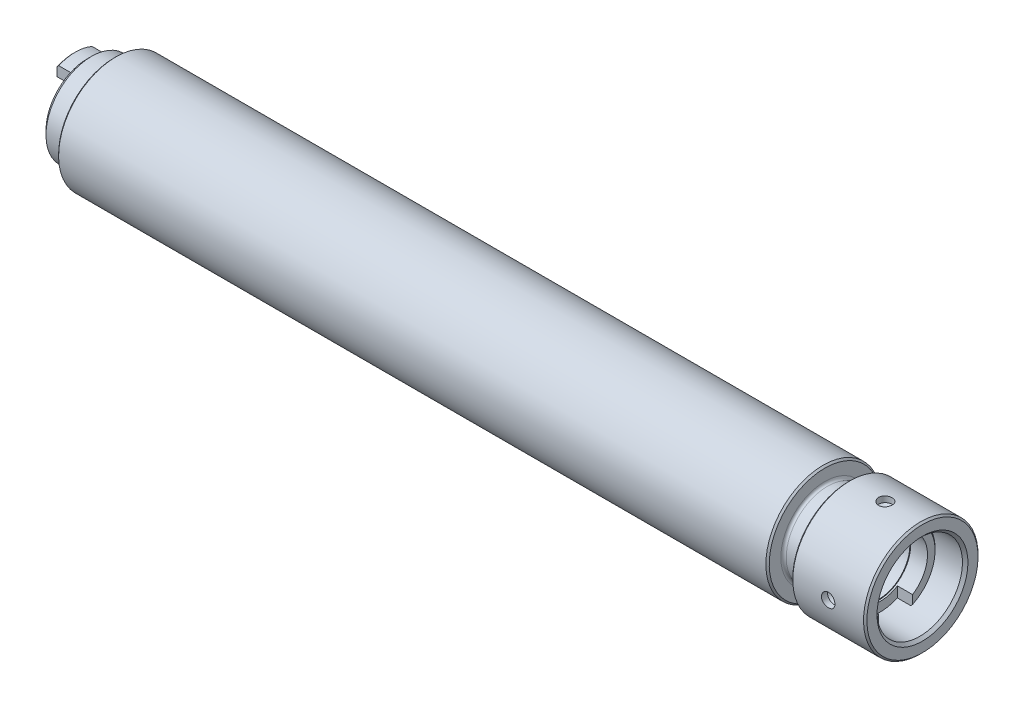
ISO-10303-21;
HEADER;
FILE_DESCRIPTION(('STEP AP214'),'2;1');
FILE_NAME('part.step','',(''),(''),'','','');
FILE_SCHEMA(('AUTOMOTIVE_DESIGN { 1 0 10303 214 1 1 1 1 }'));
ENDSEC;
DATA;
#1=APPLICATION_CONTEXT('core data for automotive mechanical design processes');
#2=APPLICATION_PROTOCOL_DEFINITION('international standard','automotive_design',2000,#1);
#3=PRODUCT_CONTEXT('',#1,'mechanical');
#4=PRODUCT('Part','Part','',(#3));
#5=PRODUCT_RELATED_PRODUCT_CATEGORY('part','',(#4));
#6=PRODUCT_DEFINITION_FORMATION('','',#4);
#7=PRODUCT_DEFINITION_CONTEXT('part definition',#1,'design');
#8=PRODUCT_DEFINITION('design','',#6,#7);
#9=PRODUCT_DEFINITION_SHAPE('','',#8);
#10=(LENGTH_UNIT() NAMED_UNIT(*) SI_UNIT(.MILLI.,.METRE.));
#11=(NAMED_UNIT(*) PLANE_ANGLE_UNIT() SI_UNIT($,.RADIAN.));
#12=(NAMED_UNIT(*) SI_UNIT($,.STERADIAN.) SOLID_ANGLE_UNIT());
#13=UNCERTAINTY_MEASURE_WITH_UNIT(LENGTH_MEASURE(1.E-05),#10,'distance_accuracy_value','');
#14=(GEOMETRIC_REPRESENTATION_CONTEXT(3) GLOBAL_UNCERTAINTY_ASSIGNED_CONTEXT((#13)) GLOBAL_UNIT_ASSIGNED_CONTEXT((#10,
#11,#12)) REPRESENTATION_CONTEXT('',''));
#15=CARTESIAN_POINT('',(0.,0.,0.));
#16=DIRECTION('',(0.,0.,1.));
#17=DIRECTION('',(1.,0.,0.));
#18=AXIS2_PLACEMENT_3D('',#15,#16,#17);
#19=CARTESIAN_POINT('',(240.,0.,0.));
#20=DIRECTION('',(1.,0.,0.));
#21=DIRECTION('',(0.,1.,0.));
#22=AXIS2_PLACEMENT_3D('',#19,#20,#21);
#23=CYLINDRICAL_SURFACE('',#22,17.);
#24=CARTESIAN_POINT('',(218.5,0.,0.));
#25=DIRECTION('',(1.,0.,0.));
#26=DIRECTION('',(0.,1.,0.));
#27=AXIS2_PLACEMENT_3D('',#24,#25,#26);
#28=CIRCLE('',#27,17.);
#29=CARTESIAN_POINT('',(218.5,17.,0.));
#30=VERTEX_POINT('',#29);
#31=EDGE_CURVE('E242',#30,#30,#28,.T.);
#32=ORIENTED_EDGE('',*,*,#31,.T.);
#33=EDGE_LOOP('',(#32));
#34=FACE_BOUND('',#33,.T.);
#35=CARTESIAN_POINT('',(231.,0.,17.));
#36=CARTESIAN_POINT('',(230.99999521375,-0.111926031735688,16.9999985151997));
#37=CARTESIAN_POINT('',(230.99057275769,-0.223923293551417,16.9988829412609));
#38=CARTESIAN_POINT('',(230.953131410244,-0.44480496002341,16.9945399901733));
#39=CARTESIAN_POINT('',(230.925092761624,-0.553685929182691,16.9913103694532));
#40=CARTESIAN_POINT('',(230.85125340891,-0.765105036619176,16.9831033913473));
#41=CARTESIAN_POINT('',(230.805464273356,-0.867647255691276,16.9781271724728));
#42=CARTESIAN_POINT('',(230.69744816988,-1.06357111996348,16.9669813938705));
#43=CARTESIAN_POINT('',(230.635224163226,-1.15695441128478,16.9608120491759));
#44=CARTESIAN_POINT('',(230.495778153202,-1.33238781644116,16.9479357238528));
#45=CARTESIAN_POINT('',(230.418491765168,-1.41438659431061,16.9412265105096));
#46=CARTESIAN_POINT('',(230.251252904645,-1.56428146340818,16.9280447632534));
#47=CARTESIAN_POINT('',(230.16129980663,-1.63217685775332,16.921572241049));
#48=CARTESIAN_POINT('',(229.97095085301,-1.75212620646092,16.9095745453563));
#49=CARTESIAN_POINT('',(229.870524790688,-1.80413253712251,16.9040522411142));
#50=CARTESIAN_POINT('',(229.662288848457,-1.89052338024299,16.8946092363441));
#51=CARTESIAN_POINT('',(229.554479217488,-1.92490848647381,16.8906884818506));
#52=CARTESIAN_POINT('',(229.335066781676,-1.97492589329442,16.8849135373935));
#53=CARTESIAN_POINT('',(229.223483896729,-1.99064446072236,16.8830498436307));
#54=CARTESIAN_POINT('',(228.999249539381,-2.00314945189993,16.881570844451));
#55=CARTESIAN_POINT('',(228.88659810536,-1.99993655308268,16.8819554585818));
#56=CARTESIAN_POINT('',(228.664023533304,-1.97474071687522,16.8849209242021));
#57=CARTESIAN_POINT('',(228.554089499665,-1.9528525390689,16.8874906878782));
#58=CARTESIAN_POINT('',(228.339465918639,-1.89107519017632,16.8945196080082));
#59=CARTESIAN_POINT('',(228.234776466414,-1.85118569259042,16.8989787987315));
#60=CARTESIAN_POINT('',(228.033317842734,-1.75443530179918,16.9092967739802));
#61=CARTESIAN_POINT('',(227.936568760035,-1.69753295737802,16.9151589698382));
#62=CARTESIAN_POINT('',(227.753957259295,-1.56840181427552,16.927619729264));
#63=CARTESIAN_POINT('',(227.668095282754,-1.49617239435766,16.9342183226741));
#64=CARTESIAN_POINT('',(227.509145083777,-1.33791096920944,16.9474577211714));
#65=CARTESIAN_POINT('',(227.436138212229,-1.25179723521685,16.9540985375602));
#66=CARTESIAN_POINT('',(227.305603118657,-1.06849379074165,16.9666362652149));
#67=CARTESIAN_POINT('',(227.248074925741,-0.97130405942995,16.9725331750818));
#68=CARTESIAN_POINT('',(227.150131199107,-0.768546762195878,16.9829217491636));
#69=CARTESIAN_POINT('',(227.109720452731,-0.662976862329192,16.9874130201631));
#70=CARTESIAN_POINT('',(227.047221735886,-0.446485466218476,16.9944805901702));
#71=CARTESIAN_POINT('',(227.025133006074,-0.335564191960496,16.9970569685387));
#72=CARTESIAN_POINT('',(227.000010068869,-0.112222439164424,16.9999941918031));
#73=CARTESIAN_POINT('',(226.996863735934,0.000185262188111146,17.0003680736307));
#74=CARTESIAN_POINT('',(227.009419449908,0.223926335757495,16.9988933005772));
#75=CARTESIAN_POINT('',(227.025121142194,0.335259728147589,16.997044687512));
#76=CARTESIAN_POINT('',(227.074834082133,0.553363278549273,16.9913408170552));
#77=CARTESIAN_POINT('',(227.108792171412,0.660145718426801,16.9874913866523));
#78=CARTESIAN_POINT('',(227.193998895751,0.866499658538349,16.978217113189));
#79=CARTESIAN_POINT('',(227.245248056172,0.966070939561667,16.9727922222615));
#80=CARTESIAN_POINT('',(227.363855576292,1.15567883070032,16.9609399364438));
#81=CARTESIAN_POINT('',(227.431286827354,1.24566955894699,16.9545080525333));
#82=CARTESIAN_POINT('',(227.580240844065,1.41309578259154,16.9413761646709));
#83=CARTESIAN_POINT('',(227.661764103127,1.49053083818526,16.9346761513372));
#84=CARTESIAN_POINT('',(227.837080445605,1.63104275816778,16.9217232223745));
#85=CARTESIAN_POINT('',(227.930933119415,1.69404552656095,16.9154727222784));
#86=CARTESIAN_POINT('',(228.127953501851,1.8033933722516,16.9041653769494));
#87=CARTESIAN_POINT('',(228.231121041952,1.84973875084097,16.8991085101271));
#88=CARTESIAN_POINT('',(228.443598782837,1.92433498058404,16.8907770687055));
#89=CARTESIAN_POINT('',(228.552893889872,1.95262833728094,16.8874983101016));
#90=CARTESIAN_POINT('',(228.774724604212,1.99045460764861,16.8830820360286));
#91=CARTESIAN_POINT('',(228.887260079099,1.9999882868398,16.8819444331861));
#92=CARTESIAN_POINT('',(229.111640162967,2.0000116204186,16.8819416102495));
#93=CARTESIAN_POINT('',(229.223484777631,1.99061767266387,16.88306250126));
#94=CARTESIAN_POINT('',(229.443994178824,1.95329812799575,16.8874205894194));
#95=CARTESIAN_POINT('',(229.552658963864,1.92537252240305,16.8906577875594));
#96=CARTESIAN_POINT('',(229.76371329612,1.85181744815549,16.8988795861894));
#97=CARTESIAN_POINT('',(229.866104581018,1.80619290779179,16.9038637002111));
#98=CARTESIAN_POINT('',(230.061796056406,1.69854661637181,16.9150186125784));
#99=CARTESIAN_POINT('',(230.155096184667,1.63652475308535,16.9211894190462));
#100=CARTESIAN_POINT('',(230.330552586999,1.49741057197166,16.9340679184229));
#101=CARTESIAN_POINT('',(230.412639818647,1.42023144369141,16.9407785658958));
#102=CARTESIAN_POINT('',(230.56274417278,1.25317277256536,16.9539542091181));
#103=CARTESIAN_POINT('',(230.630757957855,1.16329022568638,16.9604191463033));
#104=CARTESIAN_POINT('',(230.750976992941,0.973031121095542,16.9723987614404));
#105=CARTESIAN_POINT('',(230.803127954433,0.872620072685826,16.9779101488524));
#106=CARTESIAN_POINT('',(230.889755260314,0.664459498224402,16.9873277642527));
#107=CARTESIAN_POINT('',(230.924251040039,0.556718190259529,16.9912357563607));
#108=CARTESIAN_POINT('',(230.966221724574,0.373668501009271,16.9960514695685));
#109=CARTESIAN_POINT('',(230.978870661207,0.29951979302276,16.9975250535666));
#110=CARTESIAN_POINT('',(230.995761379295,0.15025808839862,16.9994998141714));
#111=CARTESIAN_POINT('',(231.000003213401,0.0751450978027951,17.0000009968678));
#112=CARTESIAN_POINT('',(231.,0.,17.));
#113=B_SPLINE_CURVE_WITH_KNOTS('',3,(#35,#36,#37,#38,#39,#40,#41,#42,#43,#44,#45,#46,#47,#48,
#49,#50,#51,#52,#53,#54,#55,#56,#57,#58,#59,#60,#61,#62,#63,#64,#65,#66,#67,#68,#69,#70,#71,#72,
#73,#74,#75,#76,#77,#78,#79,#80,#81,#82,#83,#84,#85,#86,#87,#88,#89,#90,#91,#92,#93,#94,#95,#96,
#97,#98,#99,#100,#101,#102,#103,#104,#105,#106,#107,#108,#109,#110,#111,#112),.UNSPECIFIED.,.T.,
.F.,(4,2,2,2,2,2,2,2,2,2,2,2,2,2,2,2,2,2,2,2,2,2,2,2,2,2,2,2,2,2,2,2,2,2,2,2,2,2,4),(0.,
0.33550363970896,0.67136391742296,1.00700567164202,1.34258699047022,1.67963553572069,
2.01670073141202,2.35476650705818,2.69282089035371,3.02930680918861,3.36578068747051,
3.70055735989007,4.0353401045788,4.37094527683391,4.70656405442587,5.04423583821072,
5.38190825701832,5.71967505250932,6.05742784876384,6.3931794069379,6.72892464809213,
7.06369753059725,7.39848058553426,7.73480093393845,8.07113306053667,8.409155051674,
8.74717092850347,9.08438794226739,9.42159119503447,9.75672710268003,10.091863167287,
10.4269059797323,10.7619510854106,11.0989742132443,11.4360771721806,11.7743211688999,
12.1121920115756,12.337444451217,12.5626954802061),.UNSPECIFIED.);
#114=CARTESIAN_POINT('',(231.,0.,17.));
#115=VERTEX_POINT('',#114);
#116=EDGE_CURVE('E27',#115,#115,#113,.T.);
#117=ORIENTED_EDGE('',*,*,#116,.T.);
#118=EDGE_LOOP('',(#117));
#119=FACE_BOUND('',#118,.T.);
#120=CARTESIAN_POINT('',(231.,17.,0.));
#121=CARTESIAN_POINT('',(230.99999521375,16.9999985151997,0.111926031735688));
#122=CARTESIAN_POINT('',(230.99057275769,16.9988829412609,0.223923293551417));
#123=CARTESIAN_POINT('',(230.953131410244,16.9945399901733,0.44480496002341));
#124=CARTESIAN_POINT('',(230.925092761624,16.9913103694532,0.553685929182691));
#125=CARTESIAN_POINT('',(230.85125340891,16.9831033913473,0.765105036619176));
#126=CARTESIAN_POINT('',(230.805464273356,16.9781271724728,0.867647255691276));
#127=CARTESIAN_POINT('',(230.69744816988,16.9669813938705,1.06357111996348));
#128=CARTESIAN_POINT('',(230.635224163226,16.9608120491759,1.15695441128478));
#129=CARTESIAN_POINT('',(230.495778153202,16.9479357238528,1.33238781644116));
#130=CARTESIAN_POINT('',(230.418491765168,16.9412265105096,1.41438659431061));
#131=CARTESIAN_POINT('',(230.251252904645,16.9280447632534,1.56428146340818));
#132=CARTESIAN_POINT('',(230.16129980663,16.921572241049,1.63217685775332));
#133=CARTESIAN_POINT('',(229.97095085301,16.9095745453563,1.75212620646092));
#134=CARTESIAN_POINT('',(229.870524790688,16.9040522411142,1.80413253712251));
#135=CARTESIAN_POINT('',(229.662288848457,16.8946092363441,1.89052338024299));
#136=CARTESIAN_POINT('',(229.554479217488,16.8906884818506,1.92490848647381));
#137=CARTESIAN_POINT('',(229.335066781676,16.8849135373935,1.97492589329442));
#138=CARTESIAN_POINT('',(229.223483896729,16.8830498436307,1.99064446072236));
#139=CARTESIAN_POINT('',(228.999249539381,16.881570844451,2.00314945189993));
#140=CARTESIAN_POINT('',(228.88659810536,16.8819554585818,1.99993655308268));
#141=CARTESIAN_POINT('',(228.664023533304,16.8849209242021,1.97474071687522));
#142=CARTESIAN_POINT('',(228.554089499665,16.8874906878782,1.9528525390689));
#143=CARTESIAN_POINT('',(228.339465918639,16.8945196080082,1.89107519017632));
#144=CARTESIAN_POINT('',(228.234776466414,16.8989787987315,1.85118569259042));
#145=CARTESIAN_POINT('',(228.033317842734,16.9092967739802,1.75443530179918));
#146=CARTESIAN_POINT('',(227.936568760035,16.9151589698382,1.69753295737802));
#147=CARTESIAN_POINT('',(227.753957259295,16.927619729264,1.56840181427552));
#148=CARTESIAN_POINT('',(227.668095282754,16.9342183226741,1.49617239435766));
#149=CARTESIAN_POINT('',(227.509145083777,16.9474577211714,1.33791096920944));
#150=CARTESIAN_POINT('',(227.436138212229,16.9540985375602,1.25179723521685));
#151=CARTESIAN_POINT('',(227.305603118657,16.9666362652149,1.06849379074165));
#152=CARTESIAN_POINT('',(227.248074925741,16.9725331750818,0.97130405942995));
#153=CARTESIAN_POINT('',(227.150131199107,16.9829217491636,0.768546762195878));
#154=CARTESIAN_POINT('',(227.109720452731,16.9874130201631,0.662976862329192));
#155=CARTESIAN_POINT('',(227.047221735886,16.9944805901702,0.446485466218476));
#156=CARTESIAN_POINT('',(227.025133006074,16.9970569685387,0.335564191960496));
#157=CARTESIAN_POINT('',(227.000010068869,16.9999941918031,0.112222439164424));
#158=CARTESIAN_POINT('',(226.996863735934,17.0003680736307,-0.000185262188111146));
#159=CARTESIAN_POINT('',(227.009419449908,16.9988933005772,-0.223926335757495));
#160=CARTESIAN_POINT('',(227.025121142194,16.997044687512,-0.335259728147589));
#161=CARTESIAN_POINT('',(227.074834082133,16.9913408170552,-0.553363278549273));
#162=CARTESIAN_POINT('',(227.108792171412,16.9874913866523,-0.660145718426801));
#163=CARTESIAN_POINT('',(227.193998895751,16.978217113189,-0.866499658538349));
#164=CARTESIAN_POINT('',(227.245248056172,16.9727922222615,-0.966070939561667));
#165=CARTESIAN_POINT('',(227.363855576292,16.9609399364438,-1.15567883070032));
#166=CARTESIAN_POINT('',(227.431286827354,16.9545080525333,-1.24566955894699));
#167=CARTESIAN_POINT('',(227.580240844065,16.9413761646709,-1.41309578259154));
#168=CARTESIAN_POINT('',(227.661764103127,16.9346761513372,-1.49053083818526));
#169=CARTESIAN_POINT('',(227.837080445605,16.9217232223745,-1.63104275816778));
#170=CARTESIAN_POINT('',(227.930933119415,16.9154727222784,-1.69404552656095));
#171=CARTESIAN_POINT('',(228.127953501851,16.9041653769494,-1.8033933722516));
#172=CARTESIAN_POINT('',(228.231121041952,16.8991085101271,-1.84973875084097));
#173=CARTESIAN_POINT('',(228.443598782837,16.8907770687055,-1.92433498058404));
#174=CARTESIAN_POINT('',(228.552893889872,16.8874983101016,-1.95262833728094));
#175=CARTESIAN_POINT('',(228.774724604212,16.8830820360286,-1.99045460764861));
#176=CARTESIAN_POINT('',(228.887260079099,16.8819444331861,-1.9999882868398));
#177=CARTESIAN_POINT('',(229.111640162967,16.8819416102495,-2.0000116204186));
#178=CARTESIAN_POINT('',(229.223484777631,16.88306250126,-1.99061767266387));
#179=CARTESIAN_POINT('',(229.443994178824,16.8874205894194,-1.95329812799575));
#180=CARTESIAN_POINT('',(229.552658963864,16.8906577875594,-1.92537252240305));
#181=CARTESIAN_POINT('',(229.76371329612,16.8988795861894,-1.85181744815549));
#182=CARTESIAN_POINT('',(229.866104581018,16.9038637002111,-1.80619290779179));
#183=CARTESIAN_POINT('',(230.061796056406,16.9150186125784,-1.69854661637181));
#184=CARTESIAN_POINT('',(230.155096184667,16.9211894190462,-1.63652475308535));
#185=CARTESIAN_POINT('',(230.330552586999,16.9340679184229,-1.49741057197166));
#186=CARTESIAN_POINT('',(230.412639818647,16.9407785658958,-1.42023144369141));
#187=CARTESIAN_POINT('',(230.56274417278,16.9539542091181,-1.25317277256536));
#188=CARTESIAN_POINT('',(230.630757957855,16.9604191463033,-1.16329022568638));
#189=CARTESIAN_POINT('',(230.750976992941,16.9723987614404,-0.973031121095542));
#190=CARTESIAN_POINT('',(230.803127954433,16.9779101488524,-0.872620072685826));
#191=CARTESIAN_POINT('',(230.889755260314,16.9873277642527,-0.664459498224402));
#192=CARTESIAN_POINT('',(230.924251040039,16.9912357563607,-0.556718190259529));
#193=CARTESIAN_POINT('',(230.966221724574,16.9960514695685,-0.373668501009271));
#194=CARTESIAN_POINT('',(230.978870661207,16.9975250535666,-0.29951979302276));
#195=CARTESIAN_POINT('',(230.995761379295,16.9994998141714,-0.15025808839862));
#196=CARTESIAN_POINT('',(231.000003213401,17.0000009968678,-0.0751450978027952));
#197=CARTESIAN_POINT('',(231.,17.,0.));
#198=B_SPLINE_CURVE_WITH_KNOTS('',3,(#120,#121,#122,#123,#124,#125,#126,#127,#128,#129,#130,
#131,#132,#133,#134,#135,#136,#137,#138,#139,#140,#141,#142,#143,#144,#145,#146,#147,#148,#149,
#150,#151,#152,#153,#154,#155,#156,#157,#158,#159,#160,#161,#162,#163,#164,#165,#166,#167,#168,
#169,#170,#171,#172,#173,#174,#175,#176,#177,#178,#179,#180,#181,#182,#183,#184,#185,#186,#187,
#188,#189,#190,#191,#192,#193,#194,#195,#196,#197),.UNSPECIFIED.,.T.,.F.,(4,2,2,2,2,2,2,2,2,2,2,
2,2,2,2,2,2,2,2,2,2,2,2,2,2,2,2,2,2,2,2,2,2,2,2,2,2,2,4),(0.,0.33550363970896,0.67136391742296,
1.00700567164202,1.34258699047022,1.67963553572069,2.01670073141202,2.35476650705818,
2.69282089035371,3.02930680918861,3.36578068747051,3.70055735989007,4.0353401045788,
4.37094527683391,4.70656405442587,5.04423583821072,5.38190825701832,5.71967505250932,
6.05742784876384,6.3931794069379,6.72892464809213,7.06369753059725,7.39848058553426,
7.73480093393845,8.07113306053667,8.409155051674,8.74717092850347,9.08438794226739,
9.42159119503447,9.75672710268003,10.091863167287,10.4269059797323,10.7619510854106,
11.0989742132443,11.4360771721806,11.7743211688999,12.1121920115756,12.337444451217,
12.5626954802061),.UNSPECIFIED.);
#199=CARTESIAN_POINT('',(231.,17.,0.));
#200=VERTEX_POINT('',#199);
#201=EDGE_CURVE('E203',#200,#200,#198,.T.);
#202=ORIENTED_EDGE('',*,*,#201,.T.);
#203=EDGE_LOOP('',(#202));
#204=FACE_BOUND('',#203,.T.);
#205=CARTESIAN_POINT('',(231.,-17.,0.));
#206=CARTESIAN_POINT('',(230.99999521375,-16.9999985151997,-0.111926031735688));
#207=CARTESIAN_POINT('',(230.99057275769,-16.9988829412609,-0.223923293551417));
#208=CARTESIAN_POINT('',(230.953131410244,-16.9945399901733,-0.44480496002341));
#209=CARTESIAN_POINT('',(230.925092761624,-16.9913103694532,-0.553685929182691));
#210=CARTESIAN_POINT('',(230.85125340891,-16.9831033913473,-0.765105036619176));
#211=CARTESIAN_POINT('',(230.805464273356,-16.9781271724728,-0.867647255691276));
#212=CARTESIAN_POINT('',(230.69744816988,-16.9669813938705,-1.06357111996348));
#213=CARTESIAN_POINT('',(230.635224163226,-16.9608120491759,-1.15695441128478));
#214=CARTESIAN_POINT('',(230.495778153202,-16.9479357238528,-1.33238781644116));
#215=CARTESIAN_POINT('',(230.418491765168,-16.9412265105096,-1.41438659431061));
#216=CARTESIAN_POINT('',(230.251252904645,-16.9280447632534,-1.56428146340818));
#217=CARTESIAN_POINT('',(230.16129980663,-16.921572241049,-1.63217685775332));
#218=CARTESIAN_POINT('',(229.97095085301,-16.9095745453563,-1.75212620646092));
#219=CARTESIAN_POINT('',(229.870524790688,-16.9040522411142,-1.80413253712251));
#220=CARTESIAN_POINT('',(229.662288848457,-16.8946092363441,-1.89052338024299));
#221=CARTESIAN_POINT('',(229.554479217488,-16.8906884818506,-1.92490848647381));
#222=CARTESIAN_POINT('',(229.335066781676,-16.8849135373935,-1.97492589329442));
#223=CARTESIAN_POINT('',(229.223483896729,-16.8830498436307,-1.99064446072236));
#224=CARTESIAN_POINT('',(228.999249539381,-16.881570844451,-2.00314945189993));
#225=CARTESIAN_POINT('',(228.88659810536,-16.8819554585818,-1.99993655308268));
#226=CARTESIAN_POINT('',(228.664023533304,-16.8849209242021,-1.97474071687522));
#227=CARTESIAN_POINT('',(228.554089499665,-16.8874906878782,-1.9528525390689));
#228=CARTESIAN_POINT('',(228.339465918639,-16.8945196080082,-1.89107519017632));
#229=CARTESIAN_POINT('',(228.234776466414,-16.8989787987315,-1.85118569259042));
#230=CARTESIAN_POINT('',(228.033317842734,-16.9092967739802,-1.75443530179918));
#231=CARTESIAN_POINT('',(227.936568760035,-16.9151589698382,-1.69753295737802));
#232=CARTESIAN_POINT('',(227.753957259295,-16.927619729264,-1.56840181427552));
#233=CARTESIAN_POINT('',(227.668095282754,-16.9342183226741,-1.49617239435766));
#234=CARTESIAN_POINT('',(227.509145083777,-16.9474577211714,-1.33791096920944));
#235=CARTESIAN_POINT('',(227.436138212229,-16.9540985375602,-1.25179723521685));
#236=CARTESIAN_POINT('',(227.305603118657,-16.9666362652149,-1.06849379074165));
#237=CARTESIAN_POINT('',(227.248074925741,-16.9725331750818,-0.97130405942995));
#238=CARTESIAN_POINT('',(227.150131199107,-16.9829217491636,-0.768546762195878));
#239=CARTESIAN_POINT('',(227.109720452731,-16.9874130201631,-0.662976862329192));
#240=CARTESIAN_POINT('',(227.047221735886,-16.9944805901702,-0.446485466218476));
#241=CARTESIAN_POINT('',(227.025133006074,-16.9970569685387,-0.335564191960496));
#242=CARTESIAN_POINT('',(227.000010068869,-16.9999941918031,-0.112222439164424));
#243=CARTESIAN_POINT('',(226.996863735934,-17.0003680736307,0.000185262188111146));
#244=CARTESIAN_POINT('',(227.009419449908,-16.9988933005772,0.223926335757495));
#245=CARTESIAN_POINT('',(227.025121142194,-16.997044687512,0.335259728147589));
#246=CARTESIAN_POINT('',(227.074834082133,-16.9913408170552,0.553363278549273));
#247=CARTESIAN_POINT('',(227.108792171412,-16.9874913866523,0.660145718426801));
#248=CARTESIAN_POINT('',(227.193998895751,-16.978217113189,0.866499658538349));
#249=CARTESIAN_POINT('',(227.245248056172,-16.9727922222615,0.966070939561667));
#250=CARTESIAN_POINT('',(227.363855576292,-16.9609399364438,1.15567883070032));
#251=CARTESIAN_POINT('',(227.431286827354,-16.9545080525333,1.24566955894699));
#252=CARTESIAN_POINT('',(227.580240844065,-16.9413761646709,1.41309578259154));
#253=CARTESIAN_POINT('',(227.661764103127,-16.9346761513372,1.49053083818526));
#254=CARTESIAN_POINT('',(227.837080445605,-16.9217232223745,1.63104275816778));
#255=CARTESIAN_POINT('',(227.930933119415,-16.9154727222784,1.69404552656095));
#256=CARTESIAN_POINT('',(228.127953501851,-16.9041653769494,1.8033933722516));
#257=CARTESIAN_POINT('',(228.231121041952,-16.8991085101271,1.84973875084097));
#258=CARTESIAN_POINT('',(228.443598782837,-16.8907770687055,1.92433498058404));
#259=CARTESIAN_POINT('',(228.552893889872,-16.8874983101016,1.95262833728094));
#260=CARTESIAN_POINT('',(228.774724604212,-16.8830820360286,1.99045460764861));
#261=CARTESIAN_POINT('',(228.887260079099,-16.8819444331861,1.9999882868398));
#262=CARTESIAN_POINT('',(229.111640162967,-16.8819416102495,2.0000116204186));
#263=CARTESIAN_POINT('',(229.223484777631,-16.88306250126,1.99061767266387));
#264=CARTESIAN_POINT('',(229.443994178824,-16.8874205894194,1.95329812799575));
#265=CARTESIAN_POINT('',(229.552658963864,-16.8906577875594,1.92537252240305));
#266=CARTESIAN_POINT('',(229.76371329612,-16.8988795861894,1.85181744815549));
#267=CARTESIAN_POINT('',(229.866104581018,-16.9038637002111,1.80619290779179));
#268=CARTESIAN_POINT('',(230.061796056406,-16.9150186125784,1.69854661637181));
#269=CARTESIAN_POINT('',(230.155096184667,-16.9211894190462,1.63652475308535));
#270=CARTESIAN_POINT('',(230.330552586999,-16.9340679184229,1.49741057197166));
#271=CARTESIAN_POINT('',(230.412639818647,-16.9407785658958,1.42023144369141));
#272=CARTESIAN_POINT('',(230.56274417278,-16.9539542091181,1.25317277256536));
#273=CARTESIAN_POINT('',(230.630757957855,-16.9604191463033,1.16329022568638));
#274=CARTESIAN_POINT('',(230.750976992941,-16.9723987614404,0.973031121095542));
#275=CARTESIAN_POINT('',(230.803127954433,-16.9779101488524,0.872620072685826));
#276=CARTESIAN_POINT('',(230.889755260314,-16.9873277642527,0.664459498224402));
#277=CARTESIAN_POINT('',(230.924251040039,-16.9912357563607,0.556718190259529));
#278=CARTESIAN_POINT('',(230.966221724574,-16.9960514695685,0.373668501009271));
#279=CARTESIAN_POINT('',(230.978870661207,-16.9975250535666,0.29951979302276));
#280=CARTESIAN_POINT('',(230.995761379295,-16.9994998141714,0.15025808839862));
#281=CARTESIAN_POINT('',(231.000003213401,-17.0000009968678,0.0751450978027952));
#282=CARTESIAN_POINT('',(231.,-17.,0.));
#283=B_SPLINE_CURVE_WITH_KNOTS('',3,(#205,#206,#207,#208,#209,#210,#211,#212,#213,#214,#215,
#216,#217,#218,#219,#220,#221,#222,#223,#224,#225,#226,#227,#228,#229,#230,#231,#232,#233,#234,
#235,#236,#237,#238,#239,#240,#241,#242,#243,#244,#245,#246,#247,#248,#249,#250,#251,#252,#253,
#254,#255,#256,#257,#258,#259,#260,#261,#262,#263,#264,#265,#266,#267,#268,#269,#270,#271,#272,
#273,#274,#275,#276,#277,#278,#279,#280,#281,#282),.UNSPECIFIED.,.T.,.F.,(4,2,2,2,2,2,2,2,2,2,2,
2,2,2,2,2,2,2,2,2,2,2,2,2,2,2,2,2,2,2,2,2,2,2,2,2,2,2,4),(0.,0.33550363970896,0.67136391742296,
1.00700567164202,1.34258699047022,1.67963553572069,2.01670073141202,2.35476650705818,
2.69282089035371,3.02930680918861,3.36578068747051,3.70055735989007,4.0353401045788,
4.37094527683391,4.70656405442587,5.04423583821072,5.38190825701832,5.71967505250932,
6.05742784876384,6.3931794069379,6.72892464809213,7.06369753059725,7.39848058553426,
7.73480093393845,8.07113306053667,8.409155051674,8.74717092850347,9.08438794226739,
9.42159119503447,9.75672710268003,10.091863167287,10.4269059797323,10.7619510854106,
11.0989742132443,11.4360771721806,11.7743211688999,12.1121920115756,12.337444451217,
12.5626954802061),.UNSPECIFIED.);
#284=CARTESIAN_POINT('',(231.,-17.,0.));
#285=VERTEX_POINT('',#284);
#286=EDGE_CURVE('E210',#285,#285,#283,.T.);
#287=ORIENTED_EDGE('',*,*,#286,.T.);
#288=EDGE_LOOP('',(#287));
#289=FACE_BOUND('',#288,.T.);
#290=CARTESIAN_POINT('',(239.5,0.,0.));
#291=DIRECTION('',(1.,0.,0.));
#292=DIRECTION('',(0.,1.,0.));
#293=AXIS2_PLACEMENT_3D('',#290,#291,#292);
#294=CIRCLE('',#293,17.);
#295=CARTESIAN_POINT('',(239.5,17.,0.));
#296=VERTEX_POINT('',#295);
#297=EDGE_CURVE('E245',#296,#296,#294,.T.);
#298=ORIENTED_EDGE('',*,*,#297,.F.);
#299=EDGE_LOOP('',(#298));
#300=FACE_BOUND('',#299,.T.);
#301=CARTESIAN_POINT('',(229.,2.,-16.8819430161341));
#302=CARTESIAN_POINT('',(228.888076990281,1.99999521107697,-16.8819445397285));
#303=CARTESIAN_POINT('',(228.776082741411,1.99057324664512,-16.8830680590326));
#304=CARTESIAN_POINT('',(228.55520733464,1.95313402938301,-16.8874393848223));
#305=CARTESIAN_POINT('',(228.446329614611,1.92509700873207,-16.8906894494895));
#306=CARTESIAN_POINT('',(228.234917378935,1.85126241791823,-16.898940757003));
#307=CARTESIAN_POINT('',(228.132378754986,1.80547649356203,-16.9039408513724));
#308=CARTESIAN_POINT('',(227.936460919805,1.6974679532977,-16.9151274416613));
#309=CARTESIAN_POINT('',(227.843080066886,1.63524829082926,-16.9213137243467));
#310=CARTESIAN_POINT('',(227.667643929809,1.49580667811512,-16.9342101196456));
#311=CARTESIAN_POINT('',(227.585640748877,1.41851937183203,-16.9409224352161));
#312=CARTESIAN_POINT('',(227.435737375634,1.25127682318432,-16.9540947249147));
#313=CARTESIAN_POINT('',(227.367837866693,1.16132096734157,-16.9605546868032));
#314=CARTESIAN_POINT('',(227.247884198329,0.970969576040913,-16.972516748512));
#315=CARTESIAN_POINT('',(227.195876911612,0.870544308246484,-16.9780159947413));
#316=CARTESIAN_POINT('',(227.109484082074,0.662310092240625,-16.9874128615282));
#317=CARTESIAN_POINT('',(227.075097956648,0.55450138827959,-16.9913105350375));
#318=CARTESIAN_POINT('',(227.025078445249,0.335091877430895,-16.9970495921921));
#319=CARTESIAN_POINT('',(227.009358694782,0.223511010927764,-16.9989004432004));
#320=CARTESIAN_POINT('',(226.996850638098,-0.000719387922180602,-17.0003696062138));
#321=CARTESIAN_POINT('',(227.000061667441,-0.113368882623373,-16.9999879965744));
#322=CARTESIAN_POINT('',(227.025254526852,-0.335951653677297,-16.9970429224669));
#323=CARTESIAN_POINT('',(227.047143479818,-0.445895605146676,-16.9944902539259));
#324=CARTESIAN_POINT('',(227.10892581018,-0.660538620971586,-16.9875020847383));
#325=CARTESIAN_POINT('',(227.148819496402,-0.76523759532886,-16.9830665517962));
#326=CARTESIAN_POINT('',(227.245578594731,-0.96670782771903,-16.972792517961));
#327=CARTESIAN_POINT('',(227.302484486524,-1.06345946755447,-16.9669506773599));
#328=CARTESIAN_POINT('',(227.43162321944,-1.24607458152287,-16.9545182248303));
#329=CARTESIAN_POINT('',(227.503856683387,-1.33193761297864,-16.9479275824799));
#330=CARTESIAN_POINT('',(227.662120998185,-1.49088330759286,-16.9346886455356));
#331=CARTESIAN_POINT('',(227.748232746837,-1.56388543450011,-16.9280402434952));
#332=CARTESIAN_POINT('',(227.931530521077,-1.69441189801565,-16.915474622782));
#333=CARTESIAN_POINT('',(228.028716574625,-1.75193619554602,-16.9095574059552));
#334=CARTESIAN_POINT('',(228.231472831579,-1.84987711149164,-16.8991240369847));
#335=CARTESIAN_POINT('',(228.337045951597,-1.89028774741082,-16.8946083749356));
#336=CARTESIAN_POINT('',(228.553544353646,-1.95278525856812,-16.8874991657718));
#337=CARTESIAN_POINT('',(228.664469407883,-1.97487291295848,-16.8849055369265));
#338=CARTESIAN_POINT('',(228.887812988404,-1.9999917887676,-16.8819487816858));
#339=CARTESIAN_POINT('',(229.000218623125,-2.0031361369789,-16.8815724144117));
#340=CARTESIAN_POINT('',(229.223955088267,-1.99057719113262,-16.8830578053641));
#341=CARTESIAN_POINT('',(229.335285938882,-1.97487425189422,-16.8849195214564));
#342=CARTESIAN_POINT('',(229.553376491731,-1.92516154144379,-16.8906592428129));
#343=CARTESIAN_POINT('',(229.660148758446,-1.89120613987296,-16.8945312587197));
#344=CARTESIAN_POINT('',(229.866483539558,-1.80600819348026,-16.9038504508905));
#345=CARTESIAN_POINT('',(229.966045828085,-1.75476510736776,-16.9092976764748));
#346=CARTESIAN_POINT('',(230.155647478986,-1.63616659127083,-16.9211853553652));
#347=CARTESIAN_POINT('',(230.245639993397,-1.56873672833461,-16.9276303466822));
#348=CARTESIAN_POINT('',(230.413070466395,-1.41978442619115,-16.9407729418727));
#349=CARTESIAN_POINT('',(230.490507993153,-1.33826150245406,-16.9474705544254));
#350=CARTESIAN_POINT('',(230.631025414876,-1.16294410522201,-16.9604042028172));
#351=CARTESIAN_POINT('',(230.694031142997,-1.06908997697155,-16.9666377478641));
#352=CARTESIAN_POINT('',(230.80338417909,-0.872065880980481,-16.9779039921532));
#353=CARTESIAN_POINT('',(230.849731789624,-0.768896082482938,-16.9829367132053));
#354=CARTESIAN_POINT('',(230.924329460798,-0.556419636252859,-16.9912231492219));
#355=CARTESIAN_POINT('',(230.952622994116,-0.44712842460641,-16.9944811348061));
#356=CARTESIAN_POINT('',(230.990450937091,-0.225305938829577,-16.9988686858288));
#357=CARTESIAN_POINT('',(230.999986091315,-0.112774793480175,-16.9999983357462));
#358=CARTESIAN_POINT('',(231.000013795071,0.111607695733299,-17.0000016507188));
#359=CARTESIAN_POINT('',(230.990620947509,0.223459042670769,-16.9988888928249));
#360=CARTESIAN_POINT('',(230.953301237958,0.443982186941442,-16.9945593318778));
#361=CARTESIAN_POINT('',(230.925374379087,0.552653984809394,-16.9913425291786));
#362=CARTESIAN_POINT('',(230.851814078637,0.763722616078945,-16.9831648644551));
#363=CARTESIAN_POINT('',(230.806185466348,0.866121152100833,-16.9782044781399));
#364=CARTESIAN_POINT('',(230.698528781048,1.06182543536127,-16.9670900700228));
#365=CARTESIAN_POINT('',(230.636500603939,1.1551311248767,-16.9609360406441));
#366=CARTESIAN_POINT('',(230.497379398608,1.33058739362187,-16.9480775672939));
#367=CARTESIAN_POINT('',(230.420201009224,1.41267007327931,-16.9413701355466));
#368=CARTESIAN_POINT('',(230.253145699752,1.56276558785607,-16.9281852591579));
#369=CARTESIAN_POINT('',(230.163265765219,1.63077507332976,-16.9217078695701));
#370=CARTESIAN_POINT('',(229.973008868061,1.75098938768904,-16.9096927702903));
#371=CARTESIAN_POINT('',(229.872596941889,1.8031391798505,-16.9041583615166));
#372=CARTESIAN_POINT('',(229.664434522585,1.88976405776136,-16.8946946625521));
#373=CARTESIAN_POINT('',(229.556692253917,1.92425859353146,-16.8907636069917));
#374=CARTESIAN_POINT('',(229.373645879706,1.96622583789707,-16.8859179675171));
#375=CARTESIAN_POINT('',(229.299501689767,1.97887322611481,-16.8844346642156));
#376=CARTESIAN_POINT('',(229.150249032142,1.99576188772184,-16.8824466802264));
#377=CARTESIAN_POINT('',(229.075140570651,2.00000321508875,-16.8819419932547));
#378=CARTESIAN_POINT('',(229.,2.,-16.8819430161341));
#379=B_SPLINE_CURVE_WITH_KNOTS('',3,(#301,#302,#303,#304,#305,#306,#307,#308,#309,#310,#311,
#312,#313,#314,#315,#316,#317,#318,#319,#320,#321,#322,#323,#324,#325,#326,#327,#328,#329,#330,
#331,#332,#333,#334,#335,#336,#337,#338,#339,#340,#341,#342,#343,#344,#345,#346,#347,#348,#349,
#350,#351,#352,#353,#354,#355,#356,#357,#358,#359,#360,#361,#362,#363,#364,#365,#366,#367,#368,
#369,#370,#371,#372,#373,#374,#375,#376,#377,#378),.UNSPECIFIED.,.T.,.F.,(4,2,2,2,2,2,2,2,2,2,2,
2,2,2,2,2,2,2,2,2,2,2,2,2,2,2,2,2,2,2,2,2,2,2,2,2,2,2,4),(0.,0.335494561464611,
0.671345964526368,1.00697737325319,1.34254850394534,1.6796089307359,2.01668568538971,
2.35474723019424,2.69279759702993,3.02927772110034,3.36574603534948,3.70055092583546,
4.03536155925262,4.37097528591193,4.70660265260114,5.04426231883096,5.38192283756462,
5.71970129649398,6.05746539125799,6.39321039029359,6.72894906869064,7.06369316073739,
7.39844773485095,7.73477216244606,8.07110815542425,8.40913566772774,8.74715704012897,
9.08436138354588,9.42155234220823,9.75670785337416,10.0918633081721,10.4269273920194,
10.7619936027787,11.0990048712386,11.4360962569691,11.7743444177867,12.1122191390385,
12.3374580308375,12.5626954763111),.UNSPECIFIED.);
#380=CARTESIAN_POINT('',(229.,2.,-16.8819430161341));
#381=VERTEX_POINT('',#380);
#382=EDGE_CURVE('E9',#381,#381,#379,.T.);
#383=ORIENTED_EDGE('',*,*,#382,.T.);
#384=EDGE_LOOP('',(#383));
#385=FACE_BOUND('',#384,.T.);
#386=ADVANCED_FACE('F14',(#34,#119,#204,#289,#300,#385),#23,.T.);
#387=CARTESIAN_POINT('',(-12.,0.,11.75));
#388=DIRECTION('',(-1.,0.,0.));
#389=DIRECTION('',(0.,-1.,0.));
#390=AXIS2_PLACEMENT_3D('',#387,#388,#389);
#391=PLANE('',#390);
#392=DIRECTION('',(0.,-1.,0.));
#393=VECTOR('',#392,1.);
#394=CARTESIAN_POINT('',(-12.,12.5,4.95));
#395=LINE('',#394,#393);
#396=CARTESIAN_POINT('',(-12.,-8.10848321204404,4.95));
#397=VERTEX_POINT('',#396);
#398=CARTESIAN_POINT('',(-12.,-10.6564534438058,4.95));
#399=VERTEX_POINT('',#398);
#400=EDGE_CURVE('E42',#397,#399,#395,.T.);
#401=ORIENTED_EDGE('',*,*,#400,.F.);
#402=CARTESIAN_POINT('',(-12.,0.,0.));
#403=DIRECTION('',(1.,0.,0.));
#404=DIRECTION('',(0.,1.,0.));
#405=AXIS2_PLACEMENT_3D('',#402,#403,#404);
#406=CIRCLE('',#405,9.5);
#407=CARTESIAN_POINT('',(-12.,-8.10848321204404,-4.95));
#408=VERTEX_POINT('',#407);
#409=EDGE_CURVE('E449',#397,#408,#406,.T.);
#410=ORIENTED_EDGE('',*,*,#409,.T.);
#411=DIRECTION('',(0.,1.,0.));
#412=VECTOR('',#411,1.);
#413=CARTESIAN_POINT('',(-12.,-12.5,-4.95));
#414=LINE('',#413,#412);
#415=CARTESIAN_POINT('',(-12.,-10.6564534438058,-4.95));
#416=VERTEX_POINT('',#415);
#417=EDGE_CURVE('E285',#416,#408,#414,.T.);
#418=ORIENTED_EDGE('',*,*,#417,.F.);
#419=CARTESIAN_POINT('',(-12.,0.,0.));
#420=DIRECTION('',(1.,0.,0.));
#421=DIRECTION('',(0.,1.,0.));
#422=AXIS2_PLACEMENT_3D('',#419,#420,#421);
#423=CIRCLE('',#422,11.75);
#424=EDGE_CURVE('E375',#399,#416,#423,.T.);
#425=ORIENTED_EDGE('',*,*,#424,.F.);
#426=EDGE_LOOP('',(#401,#410,#418,#425));
#427=FACE_BOUND('',#426,.T.);
#428=ADVANCED_FACE('F183',(#427),#391,.T.);
#429=CARTESIAN_POINT('',(232.,0.,0.));
#430=DIRECTION('',(1.,0.,0.));
#431=DIRECTION('',(0.,1.,0.));
#432=AXIS2_PLACEMENT_3D('',#429,#430,#431);
#433=CYLINDRICAL_SURFACE('',#432,9.5);
#434=DIRECTION('',(1.,0.,0.));
#435=VECTOR('',#434,1.);
#436=CARTESIAN_POINT('',(232.,-8.10848321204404,4.95));
#437=LINE('',#436,#435);
#438=CARTESIAN_POINT('',(-8.,-8.10848321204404,4.95));
#439=VERTEX_POINT('',#438);
#440=EDGE_CURVE('E299',#439,#397,#437,.F.);
#441=ORIENTED_EDGE('',*,*,#440,.F.);
#442=CARTESIAN_POINT('',(-8.,0.,0.));
#443=DIRECTION('',(1.,0.,0.));
#444=DIRECTION('',(0.,1.,0.));
#445=AXIS2_PLACEMENT_3D('',#442,#443,#444);
#446=CIRCLE('',#445,9.5);
#447=CARTESIAN_POINT('',(-8.,-8.10848321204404,-4.95));
#448=VERTEX_POINT('',#447);
#449=EDGE_CURVE('E445',#439,#448,#446,.T.);
#450=ORIENTED_EDGE('',*,*,#449,.T.);
#451=DIRECTION('',(1.,0.,0.));
#452=VECTOR('',#451,1.);
#453=CARTESIAN_POINT('',(232.,-8.10848321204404,-4.95));
#454=LINE('',#453,#452);
#455=EDGE_CURVE('E293',#408,#448,#454,.T.);
#456=ORIENTED_EDGE('',*,*,#455,.F.);
#457=ORIENTED_EDGE('',*,*,#409,.F.);
#458=EDGE_LOOP('',(#441,#450,#456,#457));
#459=FACE_BOUND('',#458,.T.);
#460=ADVANCED_FACE('F188',(#459),#433,.F.);
#461=CARTESIAN_POINT('',(232.,0.,0.));
#462=DIRECTION('',(1.,0.,0.));
#463=DIRECTION('',(0.,1.,0.));
#464=AXIS2_PLACEMENT_3D('',#461,#462,#463);
#465=CYLINDRICAL_SURFACE('',#464,12.25);
#466=DIRECTION('',(1.,0.,0.));
#467=VECTOR('',#466,1.);
#468=CARTESIAN_POINT('',(232.,-11.2053558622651,4.95));
#469=LINE('',#468,#467);
#470=CARTESIAN_POINT('',(-11.5,-11.2053558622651,4.95));
#471=VERTEX_POINT('',#470);
#472=CARTESIAN_POINT('',(-8.,-11.2053558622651,4.95));
#473=VERTEX_POINT('',#472);
#474=EDGE_CURVE('E295',#471,#473,#469,.T.);
#475=ORIENTED_EDGE('',*,*,#474,.F.);
#476=CARTESIAN_POINT('',(-11.5,0.,0.));
#477=DIRECTION('',(1.,0.,0.));
#478=DIRECTION('',(0.,1.,0.));
#479=AXIS2_PLACEMENT_3D('',#476,#477,#478);
#480=CIRCLE('',#479,12.25);
#481=CARTESIAN_POINT('',(-11.5,-11.2053558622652,-4.95));
#482=VERTEX_POINT('',#481);
#483=EDGE_CURVE('E379',#471,#482,#480,.T.);
#484=ORIENTED_EDGE('',*,*,#483,.T.);
#485=DIRECTION('',(1.,0.,0.));
#486=VECTOR('',#485,1.);
#487=CARTESIAN_POINT('',(232.,-11.2053558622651,-4.95));
#488=LINE('',#487,#486);
#489=CARTESIAN_POINT('',(-8.,-11.2053558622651,-4.95));
#490=VERTEX_POINT('',#489);
#491=EDGE_CURVE('E289',#490,#482,#488,.F.);
#492=ORIENTED_EDGE('',*,*,#491,.F.);
#493=CARTESIAN_POINT('',(-8.,0.,0.));
#494=DIRECTION('',(1.,0.,0.));
#495=DIRECTION('',(0.,1.,0.));
#496=AXIS2_PLACEMENT_3D('',#493,#494,#495);
#497=CIRCLE('',#496,12.25);
#498=EDGE_CURVE('E384',#473,#490,#497,.T.);
#499=ORIENTED_EDGE('',*,*,#498,.F.);
#500=EDGE_LOOP('',(#475,#484,#492,#499));
#501=FACE_BOUND('',#500,.T.);
#502=ADVANCED_FACE('F490',(#501),#465,.T.);
#503=CARTESIAN_POINT('',(-11.5,0.,0.));
#504=DIRECTION('',(1.,0.,0.));
#505=DIRECTION('',(0.,1.,0.));
#506=AXIS2_PLACEMENT_3D('',#503,#504,#505);
#507=CONICAL_SURFACE('',#506,12.25,0.785398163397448);
#508=CARTESIAN_POINT('',(3.20326090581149,26.4948254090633,4.95));
#509=CARTESIAN_POINT('',(2.5138140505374,25.7934123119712,4.95));
#510=CARTESIAN_POINT('',(1.82480125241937,25.0915713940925,4.95));
#511=CARTESIAN_POINT('',(0.447152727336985,23.6858558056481,4.95));
#512=CARTESIAN_POINT('',(-0.241481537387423,22.9819797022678,4.95));
#513=CARTESIAN_POINT('',(-1.63178185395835,21.5577677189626,4.95));
#514=CARTESIAN_POINT('',(-2.33341459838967,20.8373993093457,4.95));
#515=CARTESIAN_POINT('',(-3.73364260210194,19.3954075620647,4.95));
#516=CARTESIAN_POINT('',(-4.43224050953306,18.673786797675,4.95));
#517=CARTESIAN_POINT('',(-5.70449622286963,17.3540438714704,4.95));
#518=CARTESIAN_POINT('',(-6.278640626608,16.7563911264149,4.95));
#519=CARTESIAN_POINT('',(-7.42418169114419,15.5582993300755,4.95));
#520=CARTESIAN_POINT('',(-7.99557796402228,14.9578599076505,4.95));
#521=CARTESIAN_POINT('',(-9.13703721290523,13.7504675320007,4.95));
#522=CARTESIAN_POINT('',(-9.70708198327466,13.1434973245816,4.95));
#523=CARTESIAN_POINT('',(-10.5575651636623,12.2290725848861,4.95));
#524=CARTESIAN_POINT('',(-10.8402227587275,11.9236825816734,4.95));
#525=CARTESIAN_POINT('',(-11.403690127,11.3112036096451,4.95));
#526=CARTESIAN_POINT('',(-11.6844999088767,11.0041146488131,4.95));
#527=CARTESIAN_POINT('',(-12.2386008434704,10.3935530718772,4.95));
#528=CARTESIAN_POINT('',(-12.511934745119,10.0901192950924,4.95));
#529=CARTESIAN_POINT('',(-13.0557524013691,9.48068414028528,4.95));
#530=CARTESIAN_POINT('',(-13.3262360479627,9.17468266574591,4.95));
#531=CARTESIAN_POINT('',(-13.864026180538,8.55877296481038,4.95));
#532=CARTESIAN_POINT('',(-14.1313249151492,8.24885795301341,4.95));
#533=CARTESIAN_POINT('',(-14.6608555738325,7.6247840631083,4.95));
#534=CARTESIAN_POINT('',(-14.923088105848,7.31062570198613,4.95));
#535=CARTESIAN_POINT('',(-15.4383054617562,6.67943613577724,4.95));
#536=CARTESIAN_POINT('',(-15.6913519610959,6.36245564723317,4.95));
#537=CARTESIAN_POINT('',(-16.0636155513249,5.88117802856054,4.95));
#538=CARTESIAN_POINT('',(-16.1865214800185,5.71973505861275,4.95));
#539=CARTESIAN_POINT('',(-16.4293129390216,5.3945973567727,4.95));
#540=CARTESIAN_POINT('',(-16.5491985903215,5.23090271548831,4.95));
#541=CARTESIAN_POINT('',(-16.7848409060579,4.90144336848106,4.95));
#542=CARTESIAN_POINT('',(-16.9006107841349,4.73568814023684,4.95));
#543=CARTESIAN_POINT('',(-17.1275768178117,4.40103606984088,4.95));
#544=CARTESIAN_POINT('',(-17.2387725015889,4.23213890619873,4.95));
#545=CARTESIAN_POINT('',(-17.4552588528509,3.8908428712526,4.95));
#546=CARTESIAN_POINT('',(-17.5605557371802,3.71844795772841,4.95));
#547=CARTESIAN_POINT('',(-17.7637613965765,3.3693763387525,4.95));
#548=CARTESIAN_POINT('',(-17.8616724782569,3.19270099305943,4.95));
#549=CARTESIAN_POINT('',(-17.9750571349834,2.97465361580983,4.95));
#550=CARTESIAN_POINT('',(-17.9950675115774,2.93562401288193,4.95));
#551=CARTESIAN_POINT('',(-18.034614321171,2.85731987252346,4.95));
#552=CARTESIAN_POINT('',(-18.0541507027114,2.81804530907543,4.95));
#553=CARTESIAN_POINT('',(-18.1120142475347,2.6998345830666,4.95));
#554=CARTESIAN_POINT('',(-18.1495874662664,2.6205273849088,4.95));
#555=CARTESIAN_POINT('',(-18.2224864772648,2.46088367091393,4.95));
#556=CARTESIAN_POINT('',(-18.2578122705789,2.38054715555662,4.95));
#557=CARTESIAN_POINT('',(-18.3259522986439,2.21882193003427,4.95));
#558=CARTESIAN_POINT('',(-18.3587666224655,2.13743325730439,4.95));
#559=CARTESIAN_POINT('',(-18.4523269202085,1.89347198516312,4.95));
#560=CARTESIAN_POINT('',(-18.509021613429,1.72930986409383,4.95));
#561=CARTESIAN_POINT('',(-18.6091069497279,1.39691062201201,4.95));
#562=CARTESIAN_POINT('',(-18.6524970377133,1.22867333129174,4.95));
#563=CARTESIAN_POINT('',(-18.7178372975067,0.916284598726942,4.95));
#564=CARTESIAN_POINT('',(-18.7421164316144,0.772623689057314,4.95));
#565=CARTESIAN_POINT('',(-18.778476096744,0.483789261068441,4.95));
#566=CARTESIAN_POINT('',(-18.7905607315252,0.338616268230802,4.95));
#567=CARTESIAN_POINT('',(-18.8018909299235,0.0480543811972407,4.95));
#568=CARTESIAN_POINT('',(-18.8011622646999,-0.0973334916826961,4.95));
#569=CARTESIAN_POINT('',(-18.7869727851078,-0.38750338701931,4.95));
#570=CARTESIAN_POINT('',(-18.7735091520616,-0.532285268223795,4.95));
#571=CARTESIAN_POINT('',(-18.7298220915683,-0.855001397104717,4.95));
#572=CARTESIAN_POINT('',(-18.6963352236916,-1.0324937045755,4.95));
#573=CARTESIAN_POINT('',(-18.6130909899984,-1.38365906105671,4.95));
#574=CARTESIAN_POINT('',(-18.5633238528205,-1.55732974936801,4.95));
#575=CARTESIAN_POINT('',(-18.4783589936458,-1.81503351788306,4.95));
#576=CARTESIAN_POINT('',(-18.4481897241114,-1.9007740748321,4.95));
#577=CARTESIAN_POINT('',(-18.3847787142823,-2.0710721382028,4.95));
#578=CARTESIAN_POINT('',(-18.3515383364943,-2.15563015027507,4.95));
#579=CARTESIAN_POINT('',(-18.2823016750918,-2.32359220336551,4.95));
#580=CARTESIAN_POINT('',(-18.246305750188,-2.40699639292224,4.95));
#581=CARTESIAN_POINT('',(-18.1718449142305,-2.57270085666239,4.95));
#582=CARTESIAN_POINT('',(-18.133379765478,-2.65500102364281,4.95));
#583=CARTESIAN_POINT('',(-18.0132493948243,-2.90328628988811,4.95));
#584=CARTESIAN_POINT('',(-17.9281269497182,-3.06760427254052,4.95));
#585=CARTESIAN_POINT('',(-17.7506773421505,-3.39232358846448,4.95));
#586=CARTESIAN_POINT('',(-17.658347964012,-3.55272369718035,4.95));
#587=CARTESIAN_POINT('',(-17.4678667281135,-3.87025164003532,4.95));
#588=CARTESIAN_POINT('',(-17.3697086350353,-4.02737571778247,4.95));
#589=CARTESIAN_POINT('',(-17.1688084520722,-4.33862926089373,4.95));
#590=CARTESIAN_POINT('',(-17.0660668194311,-4.49275902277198,4.95));
#591=CARTESIAN_POINT('',(-16.8564338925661,-4.79909155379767,4.95));
#592=CARTESIAN_POINT('',(-16.7495273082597,-4.95128382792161,4.95));
#593=CARTESIAN_POINT('',(-16.5326365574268,-5.25346331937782,4.95));
#594=CARTESIAN_POINT('',(-16.4226522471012,-5.4034504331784,4.95));
#595=CARTESIAN_POINT('',(-16.0890489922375,-5.85039720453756,4.95));
#596=CARTESIAN_POINT('',(-15.8616473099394,-6.14453283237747,4.95));
#597=CARTESIAN_POINT('',(-15.3966029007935,-6.73119776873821,4.95));
#598=CARTESIAN_POINT('',(-15.1588620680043,-7.02364868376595,4.95));
#599=CARTESIAN_POINT('',(-14.6780696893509,-7.60420077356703,4.95));
#600=CARTESIAN_POINT('',(-14.4350175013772,-7.89230141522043,4.95));
#601=CARTESIAN_POINT('',(-13.9456035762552,-8.46436849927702,4.95));
#602=CARTESIAN_POINT('',(-13.6992521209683,-8.74834376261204,4.95));
#603=CARTESIAN_POINT('',(-13.2035415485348,-9.31363034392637,4.95));
#604=CARTESIAN_POINT('',(-12.9541825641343,-9.59494177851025,4.95));
#605=CARTESIAN_POINT('',(-12.3745237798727,-10.2433504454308,4.95));
#606=CARTESIAN_POINT('',(-12.0433671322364,-10.6096809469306,4.95));
#607=CARTESIAN_POINT('',(-11.3780152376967,-11.3395747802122,4.95));
#608=CARTESIAN_POINT('',(-11.0438199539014,-11.7031380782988,4.95));
#609=CARTESIAN_POINT('',(-10.3730835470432,-12.4281263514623,4.95));
#610=CARTESIAN_POINT('',(-10.0365423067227,-12.7895512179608,4.95));
#611=CARTESIAN_POINT('',(-9.36163066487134,-13.5106898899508,4.95));
#612=CARTESIAN_POINT('',(-9.02326025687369,-13.8704036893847,4.95));
#613=CARTESIAN_POINT('',(-8.00515322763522,-14.9483738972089,4.95));
#614=CARTESIAN_POINT('',(-7.32324177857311,-15.6645757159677,4.95));
#615=CARTESIAN_POINT('',(-5.95560480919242,-17.0932835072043,4.95));
#616=CARTESIAN_POINT('',(-5.26987939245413,-17.8057895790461,4.95));
#617=CARTESIAN_POINT('',(-3.93689092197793,-19.1855819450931,4.95));
#618=CARTESIAN_POINT('',(-3.28978485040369,-19.8530199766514,4.95));
#619=CARTESIAN_POINT('',(-1.99379718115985,-21.1861801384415,4.95));
#620=CARTESIAN_POINT('',(-1.34491556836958,-21.851902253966,4.95));
#621=CARTESIAN_POINT('',(-0.0467417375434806,-23.1810775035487,4.95));
#622=CARTESIAN_POINT('',(0.602548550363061,-23.844532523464,4.95));
#623=CARTESIAN_POINT('',(1.90218259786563,-25.1703951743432,4.95));
#624=CARTESIAN_POINT('',(2.5525263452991,-25.8328028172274,4.95));
#625=CARTESIAN_POINT('',(3.20326090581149,-26.4948254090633,4.95));
#626=B_SPLINE_CURVE_WITH_KNOTS('',3,(#508,#509,#510,#511,#512,#513,#514,#515,#516,#517,#518,
#519,#520,#521,#522,#523,#524,#525,#526,#527,#528,#529,#530,#531,#532,#533,#534,#535,#536,#537,
#538,#539,#540,#541,#542,#543,#544,#545,#546,#547,#548,#549,#550,#551,#552,#553,#554,#555,#556,
#557,#558,#559,#560,#561,#562,#563,#564,#565,#566,#567,#568,#569,#570,#571,#572,#573,#574,#575,
#576,#577,#578,#579,#580,#581,#582,#583,#584,#585,#586,#587,#588,#589,#590,#591,#592,#593,#594,
#595,#596,#597,#598,#599,#600,#601,#602,#603,#604,#605,#606,#607,#608,#609,#610,#611,#612,#613,
#614,#615,#616,#617,#618,#619,#620,#621,#622,#623,#624,#625),.UNSPECIFIED.,.F.,.F.,(4,2,2,2,2,2,
2,2,2,2,2,2,2,2,2,2,2,2,2,2,2,2,2,2,2,2,2,2,2,2,2,2,2,2,2,2,2,2,2,2,2,2,2,2,2,2,2,2,2,2,2,2,2,2,
2,2,2,2,4),(0.,2.95056977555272,5.90470569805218,8.92148419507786,11.9346122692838,
14.4208626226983,16.9074541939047,19.4054771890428,20.6538405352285,21.9021980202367,
23.1273580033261,24.3525642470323,25.5803111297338,26.8079097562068,28.0245445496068,
28.6332271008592,29.2418852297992,29.8483702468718,30.4549176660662,31.0608133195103,
31.6665189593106,31.7980976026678,31.9296904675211,32.1929303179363,32.456170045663,
32.7194004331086,33.2399398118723,33.7605009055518,34.1971225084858,34.6335971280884,
35.0691939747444,35.5048872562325,36.0458505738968,36.5871391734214,36.8597718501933,
37.1322841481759,37.4047610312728,37.6772641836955,38.2321818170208,38.7872707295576,
39.3429645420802,39.8986030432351,40.456520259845,41.0144635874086,42.1296545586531,
43.2602593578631,44.3910016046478,45.518795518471,46.646539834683,48.1279894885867,
49.6094571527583,51.0909994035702,52.5725468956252,55.5392597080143,58.5058923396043,
61.2947905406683,64.0837125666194,66.8686267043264,69.6535089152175),.UNSPECIFIED.);
#627=EDGE_CURVE('E473',#399,#471,#626,.T.);
#628=ORIENTED_EDGE('',*,*,#627,.F.);
#629=ORIENTED_EDGE('',*,*,#424,.T.);
#630=CARTESIAN_POINT('',(3.20326090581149,-26.4948254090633,-4.95));
#631=CARTESIAN_POINT('',(2.5138140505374,-25.7934123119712,-4.95));
#632=CARTESIAN_POINT('',(1.82480125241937,-25.0915713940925,-4.95));
#633=CARTESIAN_POINT('',(0.447152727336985,-23.6858558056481,-4.95));
#634=CARTESIAN_POINT('',(-0.241481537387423,-22.9819797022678,-4.95));
#635=CARTESIAN_POINT('',(-1.63178185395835,-21.5577677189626,-4.95));
#636=CARTESIAN_POINT('',(-2.33341459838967,-20.8373993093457,-4.95));
#637=CARTESIAN_POINT('',(-3.73364260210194,-19.3954075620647,-4.95));
#638=CARTESIAN_POINT('',(-4.43224050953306,-18.673786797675,-4.95));
#639=CARTESIAN_POINT('',(-5.70449622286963,-17.3540438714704,-4.95));
#640=CARTESIAN_POINT('',(-6.278640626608,-16.7563911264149,-4.95));
#641=CARTESIAN_POINT('',(-7.42418169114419,-15.5582993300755,-4.95));
#642=CARTESIAN_POINT('',(-7.99557796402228,-14.9578599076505,-4.95));
#643=CARTESIAN_POINT('',(-9.13703721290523,-13.7504675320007,-4.95));
#644=CARTESIAN_POINT('',(-9.70708198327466,-13.1434973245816,-4.95));
#645=CARTESIAN_POINT('',(-10.5575651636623,-12.2290725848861,-4.95));
#646=CARTESIAN_POINT('',(-10.8402227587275,-11.9236825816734,-4.95));
#647=CARTESIAN_POINT('',(-11.403690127,-11.3112036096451,-4.95));
#648=CARTESIAN_POINT('',(-11.6844999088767,-11.0041146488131,-4.95));
#649=CARTESIAN_POINT('',(-12.2386008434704,-10.3935530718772,-4.95));
#650=CARTESIAN_POINT('',(-12.511934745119,-10.0901192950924,-4.95));
#651=CARTESIAN_POINT('',(-13.0557524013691,-9.48068414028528,-4.95));
#652=CARTESIAN_POINT('',(-13.3262360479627,-9.17468266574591,-4.95));
#653=CARTESIAN_POINT('',(-13.864026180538,-8.55877296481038,-4.95));
#654=CARTESIAN_POINT('',(-14.1313249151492,-8.24885795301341,-4.95));
#655=CARTESIAN_POINT('',(-14.6608555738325,-7.6247840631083,-4.95));
#656=CARTESIAN_POINT('',(-14.923088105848,-7.31062570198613,-4.95));
#657=CARTESIAN_POINT('',(-15.4383054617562,-6.67943613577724,-4.95));
#658=CARTESIAN_POINT('',(-15.6913519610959,-6.36245564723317,-4.95));
#659=CARTESIAN_POINT('',(-16.0636155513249,-5.88117802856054,-4.95));
#660=CARTESIAN_POINT('',(-16.1865214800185,-5.71973505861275,-4.95));
#661=CARTESIAN_POINT('',(-16.4293129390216,-5.3945973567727,-4.95));
#662=CARTESIAN_POINT('',(-16.5491985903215,-5.23090271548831,-4.95));
#663=CARTESIAN_POINT('',(-16.7848409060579,-4.90144336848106,-4.95));
#664=CARTESIAN_POINT('',(-16.9006107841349,-4.73568814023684,-4.95));
#665=CARTESIAN_POINT('',(-17.1275768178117,-4.40103606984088,-4.95));
#666=CARTESIAN_POINT('',(-17.2387725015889,-4.23213890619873,-4.95));
#667=CARTESIAN_POINT('',(-17.4552588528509,-3.8908428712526,-4.95));
#668=CARTESIAN_POINT('',(-17.5605557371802,-3.71844795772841,-4.95));
#669=CARTESIAN_POINT('',(-17.7637613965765,-3.3693763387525,-4.95));
#670=CARTESIAN_POINT('',(-17.8616724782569,-3.19270099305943,-4.95));
#671=CARTESIAN_POINT('',(-17.9750571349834,-2.97465361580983,-4.95));
#672=CARTESIAN_POINT('',(-17.9950675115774,-2.93562401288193,-4.95));
#673=CARTESIAN_POINT('',(-18.034614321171,-2.85731987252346,-4.95));
#674=CARTESIAN_POINT('',(-18.0541507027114,-2.81804530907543,-4.95));
#675=CARTESIAN_POINT('',(-18.1120142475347,-2.6998345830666,-4.95));
#676=CARTESIAN_POINT('',(-18.1495874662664,-2.6205273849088,-4.95));
#677=CARTESIAN_POINT('',(-18.2224864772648,-2.46088367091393,-4.95));
#678=CARTESIAN_POINT('',(-18.2578122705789,-2.38054715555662,-4.95));
#679=CARTESIAN_POINT('',(-18.3259522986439,-2.21882193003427,-4.95));
#680=CARTESIAN_POINT('',(-18.3587666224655,-2.13743325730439,-4.95));
#681=CARTESIAN_POINT('',(-18.4523269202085,-1.89347198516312,-4.95));
#682=CARTESIAN_POINT('',(-18.509021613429,-1.72930986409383,-4.95));
#683=CARTESIAN_POINT('',(-18.6091069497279,-1.39691062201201,-4.95));
#684=CARTESIAN_POINT('',(-18.6524970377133,-1.22867333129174,-4.95));
#685=CARTESIAN_POINT('',(-18.7178372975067,-0.916284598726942,-4.95));
#686=CARTESIAN_POINT('',(-18.7421164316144,-0.772623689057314,-4.95));
#687=CARTESIAN_POINT('',(-18.778476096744,-0.483789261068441,-4.95));
#688=CARTESIAN_POINT('',(-18.7905607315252,-0.338616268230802,-4.95));
#689=CARTESIAN_POINT('',(-18.8018909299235,-0.0480543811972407,-4.95));
#690=CARTESIAN_POINT('',(-18.8011622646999,0.0973334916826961,-4.95));
#691=CARTESIAN_POINT('',(-18.7869727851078,0.38750338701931,-4.95));
#692=CARTESIAN_POINT('',(-18.7735091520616,0.532285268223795,-4.95));
#693=CARTESIAN_POINT('',(-18.7298220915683,0.855001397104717,-4.95));
#694=CARTESIAN_POINT('',(-18.6963352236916,1.0324937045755,-4.95));
#695=CARTESIAN_POINT('',(-18.6130909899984,1.38365906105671,-4.95));
#696=CARTESIAN_POINT('',(-18.5633238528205,1.55732974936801,-4.95));
#697=CARTESIAN_POINT('',(-18.4783589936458,1.81503351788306,-4.95));
#698=CARTESIAN_POINT('',(-18.4481897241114,1.9007740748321,-4.95));
#699=CARTESIAN_POINT('',(-18.3847787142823,2.0710721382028,-4.95));
#700=CARTESIAN_POINT('',(-18.3515383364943,2.15563015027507,-4.95));
#701=CARTESIAN_POINT('',(-18.2823016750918,2.32359220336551,-4.95));
#702=CARTESIAN_POINT('',(-18.246305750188,2.40699639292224,-4.95));
#703=CARTESIAN_POINT('',(-18.1718449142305,2.57270085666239,-4.95));
#704=CARTESIAN_POINT('',(-18.133379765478,2.65500102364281,-4.95));
#705=CARTESIAN_POINT('',(-18.0132493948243,2.90328628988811,-4.95));
#706=CARTESIAN_POINT('',(-17.9281269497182,3.06760427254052,-4.95));
#707=CARTESIAN_POINT('',(-17.7506773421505,3.39232358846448,-4.95));
#708=CARTESIAN_POINT('',(-17.658347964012,3.55272369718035,-4.95));
#709=CARTESIAN_POINT('',(-17.4678667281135,3.87025164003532,-4.95));
#710=CARTESIAN_POINT('',(-17.3697086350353,4.02737571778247,-4.95));
#711=CARTESIAN_POINT('',(-17.1688084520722,4.33862926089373,-4.95));
#712=CARTESIAN_POINT('',(-17.0660668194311,4.49275902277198,-4.95));
#713=CARTESIAN_POINT('',(-16.8564338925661,4.79909155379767,-4.95));
#714=CARTESIAN_POINT('',(-16.7495273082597,4.95128382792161,-4.95));
#715=CARTESIAN_POINT('',(-16.5326365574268,5.25346331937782,-4.95));
#716=CARTESIAN_POINT('',(-16.4226522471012,5.4034504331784,-4.95));
#717=CARTESIAN_POINT('',(-16.0890489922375,5.85039720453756,-4.95));
#718=CARTESIAN_POINT('',(-15.8616473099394,6.14453283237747,-4.95));
#719=CARTESIAN_POINT('',(-15.3966029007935,6.73119776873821,-4.95));
#720=CARTESIAN_POINT('',(-15.1588620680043,7.02364868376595,-4.95));
#721=CARTESIAN_POINT('',(-14.6780696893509,7.60420077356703,-4.95));
#722=CARTESIAN_POINT('',(-14.4350175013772,7.89230141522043,-4.95));
#723=CARTESIAN_POINT('',(-13.9456035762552,8.46436849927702,-4.95));
#724=CARTESIAN_POINT('',(-13.6992521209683,8.74834376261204,-4.95));
#725=CARTESIAN_POINT('',(-13.2035415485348,9.31363034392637,-4.95));
#726=CARTESIAN_POINT('',(-12.9541825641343,9.59494177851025,-4.95));
#727=CARTESIAN_POINT('',(-12.3745237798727,10.2433504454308,-4.95));
#728=CARTESIAN_POINT('',(-12.0433671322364,10.6096809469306,-4.95));
#729=CARTESIAN_POINT('',(-11.3780152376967,11.3395747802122,-4.95));
#730=CARTESIAN_POINT('',(-11.0438199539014,11.7031380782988,-4.95));
#731=CARTESIAN_POINT('',(-10.3730835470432,12.4281263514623,-4.95));
#732=CARTESIAN_POINT('',(-10.0365423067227,12.7895512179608,-4.95));
#733=CARTESIAN_POINT('',(-9.36163066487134,13.5106898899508,-4.95));
#734=CARTESIAN_POINT('',(-9.02326025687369,13.8704036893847,-4.95));
#735=CARTESIAN_POINT('',(-8.00515322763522,14.9483738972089,-4.95));
#736=CARTESIAN_POINT('',(-7.32324177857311,15.6645757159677,-4.95));
#737=CARTESIAN_POINT('',(-5.95560480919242,17.0932835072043,-4.95));
#738=CARTESIAN_POINT('',(-5.26987939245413,17.8057895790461,-4.95));
#739=CARTESIAN_POINT('',(-3.93689092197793,19.1855819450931,-4.95));
#740=CARTESIAN_POINT('',(-3.28978485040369,19.8530199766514,-4.95));
#741=CARTESIAN_POINT('',(-1.99379718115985,21.1861801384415,-4.95));
#742=CARTESIAN_POINT('',(-1.34491556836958,21.851902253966,-4.95));
#743=CARTESIAN_POINT('',(-0.0467417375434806,23.1810775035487,-4.95));
#744=CARTESIAN_POINT('',(0.602548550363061,23.844532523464,-4.95));
#745=CARTESIAN_POINT('',(1.90218259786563,25.1703951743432,-4.95));
#746=CARTESIAN_POINT('',(2.5525263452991,25.8328028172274,-4.95));
#747=CARTESIAN_POINT('',(3.20326090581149,26.4948254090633,-4.95));
#748=B_SPLINE_CURVE_WITH_KNOTS('',3,(#630,#631,#632,#633,#634,#635,#636,#637,#638,#639,#640,
#641,#642,#643,#644,#645,#646,#647,#648,#649,#650,#651,#652,#653,#654,#655,#656,#657,#658,#659,
#660,#661,#662,#663,#664,#665,#666,#667,#668,#669,#670,#671,#672,#673,#674,#675,#676,#677,#678,
#679,#680,#681,#682,#683,#684,#685,#686,#687,#688,#689,#690,#691,#692,#693,#694,#695,#696,#697,
#698,#699,#700,#701,#702,#703,#704,#705,#706,#707,#708,#709,#710,#711,#712,#713,#714,#715,#716,
#717,#718,#719,#720,#721,#722,#723,#724,#725,#726,#727,#728,#729,#730,#731,#732,#733,#734,#735,
#736,#737,#738,#739,#740,#741,#742,#743,#744,#745,#746,#747),.UNSPECIFIED.,.F.,.F.,(4,2,2,2,2,2,
2,2,2,2,2,2,2,2,2,2,2,2,2,2,2,2,2,2,2,2,2,2,2,2,2,2,2,2,2,2,2,2,2,2,2,2,2,2,2,2,2,2,2,2,2,2,2,2,
2,2,2,2,4),(0.,2.95056977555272,5.90470569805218,8.92148419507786,11.9346122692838,
14.4208626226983,16.9074541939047,19.4054771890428,20.6538405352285,21.9021980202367,
23.1273580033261,24.3525642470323,25.5803111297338,26.8079097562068,28.0245445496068,
28.6332271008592,29.2418852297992,29.8483702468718,30.4549176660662,31.0608133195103,
31.6665189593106,31.7980976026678,31.9296904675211,32.1929303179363,32.456170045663,
32.7194004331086,33.2399398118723,33.7605009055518,34.1971225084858,34.6335971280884,
35.0691939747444,35.5048872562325,36.0458505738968,36.5871391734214,36.8597718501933,
37.1322841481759,37.4047610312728,37.6772641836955,38.2321818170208,38.7872707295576,
39.3429645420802,39.8986030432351,40.456520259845,41.0144635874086,42.1296545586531,
43.2602593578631,44.3910016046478,45.518795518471,46.646539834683,48.1279894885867,
49.6094571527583,51.0909994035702,52.5725468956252,55.5392597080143,58.5058923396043,
61.2947905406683,64.0837125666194,66.8686267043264,69.6535089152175),.UNSPECIFIED.);
#749=EDGE_CURVE('E472',#482,#416,#748,.T.);
#750=ORIENTED_EDGE('',*,*,#749,.F.);
#751=ORIENTED_EDGE('',*,*,#483,.F.);
#752=EDGE_LOOP('',(#628,#629,#750,#751));
#753=FACE_BOUND('',#752,.T.);
#754=ADVANCED_FACE('F484',(#753),#507,.T.);
#755=CARTESIAN_POINT('',(232.,0.,0.));
#756=DIRECTION('',(1.,0.,0.));
#757=DIRECTION('',(0.,1.,0.));
#758=AXIS2_PLACEMENT_3D('',#755,#756,#757);
#759=CYLINDRICAL_SURFACE('',#758,9.5);
#760=DIRECTION('',(1.,0.,0.));
#761=VECTOR('',#760,1.);
#762=CARTESIAN_POINT('',(232.,8.04658312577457,5.05));
#763=LINE('',#762,#761);
#764=CARTESIAN_POINT('',(227.5,8.04658312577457,5.05));
#765=VERTEX_POINT('',#764);
#766=CARTESIAN_POINT('',(232.,8.04658312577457,5.05));
#767=VERTEX_POINT('',#766);
#768=EDGE_CURVE('E361',#765,#767,#763,.T.);
#769=ORIENTED_EDGE('',*,*,#768,.T.);
#770=CARTESIAN_POINT('',(232.,0.,0.));
#771=DIRECTION('',(1.,0.,0.));
#772=DIRECTION('',(0.,1.,0.));
#773=AXIS2_PLACEMENT_3D('',#770,#771,#772);
#774=CIRCLE('',#773,9.5);
#775=CARTESIAN_POINT('',(232.,-8.04658312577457,5.05));
#776=VERTEX_POINT('',#775);
#777=EDGE_CURVE('E430',#767,#776,#774,.T.);
#778=ORIENTED_EDGE('',*,*,#777,.T.);
#779=DIRECTION('',(1.,0.,0.));
#780=VECTOR('',#779,1.);
#781=CARTESIAN_POINT('',(232.,-8.04658312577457,5.05));
#782=LINE('',#781,#780);
#783=CARTESIAN_POINT('',(227.5,-8.04658312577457,5.05));
#784=VERTEX_POINT('',#783);
#785=EDGE_CURVE('E327',#776,#784,#782,.F.);
#786=ORIENTED_EDGE('',*,*,#785,.T.);
#787=CARTESIAN_POINT('',(227.5,0.,0.));
#788=DIRECTION('',(1.,0.,0.));
#789=DIRECTION('',(0.,1.,0.));
#790=AXIS2_PLACEMENT_3D('',#787,#788,#789);
#791=CIRCLE('',#790,9.5);
#792=CARTESIAN_POINT('',(227.5,-8.04658312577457,-5.05));
#793=VERTEX_POINT('',#792);
#794=EDGE_CURVE('E371',#784,#793,#791,.T.);
#795=ORIENTED_EDGE('',*,*,#794,.T.);
#796=DIRECTION('',(1.,0.,0.));
#797=VECTOR('',#796,1.);
#798=CARTESIAN_POINT('',(232.,-8.04658312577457,-5.05));
#799=LINE('',#798,#797);
#800=CARTESIAN_POINT('',(232.,-8.04658312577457,-5.05));
#801=VERTEX_POINT('',#800);
#802=EDGE_CURVE('E365',#793,#801,#799,.T.);
#803=ORIENTED_EDGE('',*,*,#802,.T.);
#804=CARTESIAN_POINT('',(232.,8.04658312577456,-5.05));
#805=VERTEX_POINT('',#804);
#806=EDGE_CURVE('E429',#801,#805,#774,.T.);
#807=ORIENTED_EDGE('',*,*,#806,.T.);
#808=DIRECTION('',(1.,0.,0.));
#809=VECTOR('',#808,1.);
#810=CARTESIAN_POINT('',(232.,8.04658312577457,-5.05));
#811=LINE('',#810,#809);
#812=CARTESIAN_POINT('',(227.5,8.04658312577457,-5.05));
#813=VERTEX_POINT('',#812);
#814=EDGE_CURVE('E362',#805,#813,#811,.F.);
#815=ORIENTED_EDGE('',*,*,#814,.T.);
#816=EDGE_CURVE('E368',#813,#765,#791,.T.);
#817=ORIENTED_EDGE('',*,*,#816,.T.);
#818=EDGE_LOOP('',(#769,#778,#786,#795,#803,#807,#815,#817));
#819=FACE_BOUND('',#818,.T.);
#820=CARTESIAN_POINT('',(227.,0.,0.));
#821=DIRECTION('',(1.,0.,0.));
#822=DIRECTION('',(0.,1.,0.));
#823=AXIS2_PLACEMENT_3D('',#820,#821,#822);
#824=CIRCLE('',#823,9.5);
#825=CARTESIAN_POINT('',(227.,9.5,0.));
#826=VERTEX_POINT('',#825);
#827=EDGE_CURVE('E433',#826,#826,#824,.T.);
#828=ORIENTED_EDGE('',*,*,#827,.F.);
#829=EDGE_LOOP('',(#828));
#830=FACE_BOUND('',#829,.T.);
#831=ADVANCED_FACE('F567',(#819,#830),#759,.F.);
#832=CARTESIAN_POINT('',(232.,0.,9.5));
#833=DIRECTION('',(1.,0.,0.));
#834=DIRECTION('',(0.,1.,0.));
#835=AXIS2_PLACEMENT_3D('',#832,#833,#834);
#836=PLANE('',#835);
#837=CARTESIAN_POINT('',(232.,0.,0.));
#838=DIRECTION('',(1.,0.,0.));
#839=DIRECTION('',(0.,1.,0.));
#840=AXIS2_PLACEMENT_3D('',#837,#838,#839);
#841=CIRCLE('',#840,11.75);
#842=CARTESIAN_POINT('',(232.,-10.6094297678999,-5.05));
#843=VERTEX_POINT('',#842);
#844=CARTESIAN_POINT('',(232.,10.6094297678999,-5.05));
#845=VERTEX_POINT('',#844);
#846=EDGE_CURVE('E425',#843,#845,#841,.T.);
#847=ORIENTED_EDGE('',*,*,#846,.T.);
#848=DIRECTION('',(0.,1.,0.));
#849=VECTOR('',#848,1.);
#850=CARTESIAN_POINT('',(232.,-12.5,-5.05));
#851=LINE('',#850,#849);
#852=EDGE_CURVE('E310',#805,#845,#851,.T.);
#853=ORIENTED_EDGE('',*,*,#852,.F.);
#854=ORIENTED_EDGE('',*,*,#806,.F.);
#855=EDGE_CURVE('E312',#843,#801,#851,.T.);
#856=ORIENTED_EDGE('',*,*,#855,.F.);
#857=EDGE_LOOP('',(#847,#853,#854,#856));
#858=FACE_BOUND('',#857,.T.);
#859=ADVANCED_FACE('F574',(#858),#836,.T.);
#860=ORIENTED_EDGE('',*,*,#777,.F.);
#861=DIRECTION('',(0.,1.,0.));
#862=VECTOR('',#861,1.);
#863=CARTESIAN_POINT('',(232.,-12.5,5.05));
#864=LINE('',#863,#862);
#865=CARTESIAN_POINT('',(232.,10.6094297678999,5.05));
#866=VERTEX_POINT('',#865);
#867=EDGE_CURVE('E306',#767,#866,#864,.T.);
#868=ORIENTED_EDGE('',*,*,#867,.T.);
#869=CARTESIAN_POINT('',(232.,-10.6094297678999,5.05));
#870=VERTEX_POINT('',#869);
#871=EDGE_CURVE('E426',#866,#870,#841,.T.);
#872=ORIENTED_EDGE('',*,*,#871,.T.);
#873=EDGE_CURVE('E309',#870,#776,#864,.T.);
#874=ORIENTED_EDGE('',*,*,#873,.T.);
#875=EDGE_LOOP('',(#860,#868,#872,#874));
#876=FACE_BOUND('',#875,.T.);
#877=ADVANCED_FACE('F591',(#876),#836,.T.);
#878=CARTESIAN_POINT('',(232.,0.,0.));
#879=DIRECTION('',(-1.,0.,0.));
#880=DIRECTION('',(0.,-1.,0.));
#881=AXIS2_PLACEMENT_3D('',#878,#879,#880);
#882=CONICAL_SURFACE('',#881,11.75,0.785398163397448);
#883=CARTESIAN_POINT('',(231.5,0.,0.));
#884=DIRECTION('',(1.,0.,0.));
#885=DIRECTION('',(0.,1.,0.));
#886=AXIS2_PLACEMENT_3D('',#883,#884,#885);
#887=CIRCLE('',#886,12.25);
#888=CARTESIAN_POINT('',(231.5,-11.160645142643,-5.05));
#889=VERTEX_POINT('',#888);
#890=CARTESIAN_POINT('',(231.5,11.160645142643,-5.05));
#891=VERTEX_POINT('',#890);
#892=EDGE_CURVE('E421',#889,#891,#887,.T.);
#893=ORIENTED_EDGE('',*,*,#892,.T.);
#894=CARTESIAN_POINT('',(216.796739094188,26.4759470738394,-5.05));
#895=CARTESIAN_POINT('',(217.474116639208,25.7863220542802,-5.05));
#896=CARTESIAN_POINT('',(218.15105572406,25.0962651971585,-5.05));
#897=CARTESIAN_POINT('',(219.504597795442,23.7140705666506,-5.05));
#898=CARTESIAN_POINT('',(220.181199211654,23.0219312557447,-5.05));
#899=CARTESIAN_POINT('',(221.548072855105,21.6205322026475,-5.05));
#900=CARTESIAN_POINT('',(222.238309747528,20.9112379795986,-5.05));
#901=CARTESIAN_POINT('',(223.615709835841,19.4914560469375,-5.05));
#902=CARTESIAN_POINT('',(224.302875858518,18.7809710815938,-5.05));
#903=CARTESIAN_POINT('',(225.569764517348,17.4655328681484,-5.05));
#904=CARTESIAN_POINT('',(226.149910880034,16.8609880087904,-5.05));
#905=CARTESIAN_POINT('',(227.307341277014,15.6489901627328,-5.05));
#906=CARTESIAN_POINT('',(227.884624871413,15.0415367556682,-5.05));
#907=CARTESIAN_POINT('',(229.037938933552,13.8196761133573,-5.05));
#908=CARTESIAN_POINT('',(229.613948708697,13.2052492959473,-5.05));
#909=CARTESIAN_POINT('',(230.473149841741,12.2794659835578,-5.05));
#910=CARTESIAN_POINT('',(230.758667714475,11.9702692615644,-5.05));
#911=CARTESIAN_POINT('',(231.327763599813,11.3500968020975,-5.05));
#912=CARTESIAN_POINT('',(231.611341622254,11.0391210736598,-5.05));
#913=CARTESIAN_POINT('',(232.170384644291,10.4212264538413,-5.05));
#914=CARTESIAN_POINT('',(232.445898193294,10.1143515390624,-5.05));
#915=CARTESIAN_POINT('',(232.993933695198,9.49791546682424,-5.05));
#916=CARTESIAN_POINT('',(233.266455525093,9.18835419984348,-5.05));
#917=CARTESIAN_POINT('',(233.80818503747,8.56510485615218,-5.05));
#918=CARTESIAN_POINT('',(234.077383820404,8.25140902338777,-5.05));
#919=CARTESIAN_POINT('',(234.610439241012,7.61957081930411,-5.05));
#920=CARTESIAN_POINT('',(234.874296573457,7.30142903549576,-5.05));
#921=CARTESIAN_POINT('',(235.392148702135,6.66228853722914,-5.05));
#922=CARTESIAN_POINT('',(235.64621451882,6.34134781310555,-5.05));
#923=CARTESIAN_POINT('',(236.019589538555,5.85385066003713,-5.05));
#924=CARTESIAN_POINT('',(236.142799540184,5.69028289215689,-5.05));
#925=CARTESIAN_POINT('',(236.386020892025,5.36079025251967,-5.05));
#926=CARTESIAN_POINT('',(236.50603238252,5.19486548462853,-5.05));
#927=CARTESIAN_POINT('',(236.741664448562,4.86088639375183,-5.05));
#928=CARTESIAN_POINT('',(236.857300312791,4.69284288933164,-5.05));
#929=CARTESIAN_POINT('',(237.08372141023,4.35347635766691,-5.05));
#930=CARTESIAN_POINT('',(237.194506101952,4.1821529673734,-5.05));
#931=CARTESIAN_POINT('',(237.409805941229,3.8358747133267,-5.05));
#932=CARTESIAN_POINT('',(237.514328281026,3.66092433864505,-5.05));
#933=CARTESIAN_POINT('',(237.715533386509,3.30659277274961,-5.05));
#934=CARTESIAN_POINT('',(237.812218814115,3.1272131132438,-5.05));
#935=CARTESIAN_POINT('',(237.923620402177,2.90608699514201,-5.05));
#936=CARTESIAN_POINT('',(237.943146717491,2.86674543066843,-5.05));
#937=CARTESIAN_POINT('',(237.981705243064,2.7878148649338,-5.05));
#938=CARTESIAN_POINT('',(238.000737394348,2.74822583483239,-5.05));
#939=CARTESIAN_POINT('',(238.057057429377,2.62906766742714,-5.05));
#940=CARTESIAN_POINT('',(238.093559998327,2.54912505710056,-5.05));
#941=CARTESIAN_POINT('',(238.164228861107,2.3882134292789,-5.05));
#942=CARTESIAN_POINT('',(238.198395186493,2.30724442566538,-5.05));
#943=CARTESIAN_POINT('',(238.264128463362,2.14425916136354,-5.05));
#944=CARTESIAN_POINT('',(238.295695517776,2.06224294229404,-5.05));
#945=CARTESIAN_POINT('',(238.355583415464,1.89815472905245,-5.05));
#946=CARTESIAN_POINT('',(238.383938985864,1.816095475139,-5.05));
#947=CARTESIAN_POINT('',(238.437550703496,1.65097568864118,-5.05));
#948=CARTESIAN_POINT('',(238.462806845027,1.56791515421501,-5.05));
#949=CARTESIAN_POINT('',(238.533485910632,1.31726248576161,-5.05));
#950=CARTESIAN_POINT('',(238.573825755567,1.14818240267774,-5.05));
#951=CARTESIAN_POINT('',(238.633939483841,0.831891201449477,-5.05));
#952=CARTESIAN_POINT('',(238.655854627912,0.6850866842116,-5.05));
#953=CARTESIAN_POINT('',(238.687070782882,0.390164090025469,-5.05));
#954=CARTESIAN_POINT('',(238.696376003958,0.242046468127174,-5.05));
#955=CARTESIAN_POINT('',(238.70187856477,-0.0542677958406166,-5.05));
#956=CARTESIAN_POINT('',(238.698090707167,-0.202464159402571,-5.05));
#957=CARTESIAN_POINT('',(238.677650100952,-0.497981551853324,-5.05));
#958=CARTESIAN_POINT('',(238.660994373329,-0.645302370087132,-5.05));
#959=CARTESIAN_POINT('',(238.609347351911,-0.978738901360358,-5.05));
#960=CARTESIAN_POINT('',(238.57054820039,-1.16426453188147,-5.05));
#961=CARTESIAN_POINT('',(238.47601233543,-1.53098995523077,-5.05));
#962=CARTESIAN_POINT('',(238.420264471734,-1.71218681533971,-5.05));
#963=CARTESIAN_POINT('',(238.326052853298,-1.98085953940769,-5.05));
#964=CARTESIAN_POINT('',(238.292751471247,-2.07019745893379,-5.05));
#965=CARTESIAN_POINT('',(238.223016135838,-2.24759842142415,-5.05));
#966=CARTESIAN_POINT('',(238.186583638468,-2.33566203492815,-5.05));
#967=CARTESIAN_POINT('',(238.110920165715,-2.51056547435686,-5.05));
#968=CARTESIAN_POINT('',(238.07168939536,-2.5974053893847,-5.05));
#969=CARTESIAN_POINT('',(237.99073130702,-2.76992357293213,-5.05));
#970=CARTESIAN_POINT('',(237.949003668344,-2.85560169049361,-5.05));
#971=CARTESIAN_POINT('',(237.835144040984,-3.08186828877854,-5.05));
#972=CARTESIAN_POINT('',(237.761076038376,-3.22148402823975,-5.05));
#973=CARTESIAN_POINT('',(237.607936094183,-3.49795543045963,-5.05));
#974=CARTESIAN_POINT('',(237.528863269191,-3.63481060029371,-5.05));
#975=CARTESIAN_POINT('',(237.366547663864,-3.90612207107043,-5.05));
#976=CARTESIAN_POINT('',(237.283302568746,-4.04057698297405,-5.05));
#977=CARTESIAN_POINT('',(237.113374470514,-4.3073013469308,-5.05));
#978=CARTESIAN_POINT('',(237.026691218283,-4.43957063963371,-5.05));
#979=CARTESIAN_POINT('',(236.761913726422,-4.83415964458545,-5.05));
#980=CARTESIAN_POINT('',(236.579504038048,-5.09358417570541,-5.05));
#981=CARTESIAN_POINT('',(236.206592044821,-5.60636762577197,-5.05));
#982=CARTESIAN_POINT('',(236.016092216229,-5.85972836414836,-5.05));
#983=CARTESIAN_POINT('',(235.627330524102,-6.36406172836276,-5.05));
#984=CARTESIAN_POINT('',(235.429014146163,-6.61499219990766,-5.05));
#985=CARTESIAN_POINT('',(235.027757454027,-7.1131407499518,-5.05));
#986=CARTESIAN_POINT('',(234.824816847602,-7.3603585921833,-5.05));
#987=CARTESIAN_POINT('',(234.415722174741,-7.85141038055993,-5.05));
#988=CARTESIAN_POINT('',(234.209574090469,-8.09524932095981,-5.05));
#989=CARTESIAN_POINT('',(233.794490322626,-8.5805266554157,-5.05));
#990=CARTESIAN_POINT('',(233.585554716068,-8.821965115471,-5.05));
#991=CARTESIAN_POINT('',(233.036521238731,-9.45049985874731,-5.05));
#992=CARTESIAN_POINT('',(232.694636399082,-9.83603424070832,-5.05));
#993=CARTESIAN_POINT('',(232.00669670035,-10.6033691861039,-5.05));
#994=CARTESIAN_POINT('',(231.660641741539,-10.9851696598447,-5.05));
#995=CARTESIAN_POINT('',(230.965394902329,-11.7459555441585,-5.05));
#996=CARTESIAN_POINT('',(230.616202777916,-12.1249407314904,-5.05));
#997=CARTESIAN_POINT('',(229.915438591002,-12.880705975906,-5.05));
#998=CARTESIAN_POINT('',(229.563866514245,-13.2574860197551,-5.05));
#999=CARTESIAN_POINT('',(228.858510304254,-14.0096768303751,-5.05));
#1000=CARTESIAN_POINT('',(228.504724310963,-14.3850858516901,-5.05));
#1001=CARTESIAN_POINT('',(227.795664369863,-15.1344965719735,-5.05));
#1002=CARTESIAN_POINT('',(227.440390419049,-15.5084982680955,-5.05));
#1003=CARTESIAN_POINT('',(226.372813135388,-16.6287599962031,-5.05));
#1004=CARTESIAN_POINT('',(225.658719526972,-17.3733137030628,-5.05));
#1005=CARTESIAN_POINT('',(224.267719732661,-18.8173291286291,-5.05));
#1006=CARTESIAN_POINT('',(223.590991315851,-19.5169623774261,-5.05));
#1007=CARTESIAN_POINT('',(222.235416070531,-20.9141929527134,-5.05));
#1008=CARTESIAN_POINT('',(221.556569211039,-21.6117902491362,-5.05));
#1009=CARTESIAN_POINT('',(220.198237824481,-23.0044924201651,-5.05));
#1010=CARTESIAN_POINT('',(219.518755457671,-23.6995994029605,-5.05));
#1011=CARTESIAN_POINT('',(218.158576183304,-25.0885987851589,-5.05));
#1012=CARTESIAN_POINT('',(217.477879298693,-25.7824912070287,-5.05));
#1013=CARTESIAN_POINT('',(216.796739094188,-26.4759470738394,-5.05));
#1014=B_SPLINE_CURVE_WITH_KNOTS('',3,(#894,#895,#896,#897,#898,#899,#900,#901,#902,#903,#904,
#905,#906,#907,#908,#909,#910,#911,#912,#913,#914,#915,#916,#917,#918,#919,#920,#921,#922,#923,
#924,#925,#926,#927,#928,#929,#930,#931,#932,#933,#934,#935,#936,#937,#938,#939,#940,#941,#942,
#943,#944,#945,#946,#947,#948,#949,#950,#951,#952,#953,#954,#955,#956,#957,#958,#959,#960,#961,
#962,#963,#964,#965,#966,#967,#968,#969,#970,#971,#972,#973,#974,#975,#976,#977,#978,#979,#980,
#981,#982,#983,#984,#985,#986,#987,#988,#989,#990,#991,#992,#993,#994,#995,#996,#997,#998,#999,
#1000,#1001,#1002,#1003,#1004,#1005,#1006,#1007,#1008,#1009,#1010,#1011,#1012,#1013),
.UNSPECIFIED.,.F.,.F.,(4,2,2,2,2,2,2,2,2,2,2,2,2,2,2,2,2,2,2,2,2,2,2,2,2,2,2,2,2,2,2,2,2,2,2,2,
2,2,2,2,2,2,2,2,2,2,2,2,2,2,2,2,2,2,2,2,2,2,2,4),(0.,2.89996778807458,5.80369079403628,
8.77281649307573,11.7380881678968,14.2517231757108,16.7657331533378,19.2923113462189,
20.5548848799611,21.8174520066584,23.0546592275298,24.2919171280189,25.5319760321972,
26.771872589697,27.9996949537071,28.6140072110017,29.2282924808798,29.8401839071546,
30.452143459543,31.0633861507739,31.6744203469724,31.8061803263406,31.9379559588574,
32.2015663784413,32.4651732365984,32.7287696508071,32.9891691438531,33.2495691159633,
33.7703151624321,34.2151202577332,34.6597768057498,35.103930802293,35.5481876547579,
36.1158398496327,36.6838663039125,36.9698467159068,37.2556948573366,37.5415220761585,
37.8273860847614,38.3013892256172,38.7754762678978,39.2498293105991,39.7242167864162,
40.6753656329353,41.6262254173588,42.5856619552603,43.5451592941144,44.5030420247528,
45.4608983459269,47.0067162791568,48.5525712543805,50.0985475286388,51.644533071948,
53.1920641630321,54.7395983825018,57.8345142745,60.7546177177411,63.6747640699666,
66.5908951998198,69.5069718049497),.UNSPECIFIED.);
#1015=EDGE_CURVE('E353',#891,#845,#1014,.T.);
#1016=ORIENTED_EDGE('',*,*,#1015,.T.);
#1017=ORIENTED_EDGE('',*,*,#846,.F.);
#1018=EDGE_CURVE('E360',#843,#889,#1014,.T.);
#1019=ORIENTED_EDGE('',*,*,#1018,.T.);
#1020=EDGE_LOOP('',(#893,#1016,#1017,#1019));
#1021=FACE_BOUND('',#1020,.T.);
#1022=ADVANCED_FACE('F329',(#1021),#882,.T.);
#1023=ORIENTED_EDGE('',*,*,#871,.F.);
#1024=CARTESIAN_POINT('',(216.796739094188,-26.4759470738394,5.05));
#1025=CARTESIAN_POINT('',(217.474116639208,-25.7863220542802,5.05));
#1026=CARTESIAN_POINT('',(218.15105572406,-25.0962651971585,5.05));
#1027=CARTESIAN_POINT('',(219.504597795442,-23.7140705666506,5.05));
#1028=CARTESIAN_POINT('',(220.181199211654,-23.0219312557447,5.05));
#1029=CARTESIAN_POINT('',(221.548072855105,-21.6205322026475,5.05));
#1030=CARTESIAN_POINT('',(222.238309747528,-20.9112379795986,5.05));
#1031=CARTESIAN_POINT('',(223.615709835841,-19.4914560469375,5.05));
#1032=CARTESIAN_POINT('',(224.302875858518,-18.7809710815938,5.05));
#1033=CARTESIAN_POINT('',(225.569764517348,-17.4655328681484,5.05));
#1034=CARTESIAN_POINT('',(226.149910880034,-16.8609880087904,5.05));
#1035=CARTESIAN_POINT('',(227.307341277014,-15.6489901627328,5.05));
#1036=CARTESIAN_POINT('',(227.884624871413,-15.0415367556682,5.05));
#1037=CARTESIAN_POINT('',(229.037938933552,-13.8196761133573,5.05));
#1038=CARTESIAN_POINT('',(229.613948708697,-13.2052492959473,5.05));
#1039=CARTESIAN_POINT('',(230.473149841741,-12.2794659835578,5.05));
#1040=CARTESIAN_POINT('',(230.758667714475,-11.9702692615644,5.05));
#1041=CARTESIAN_POINT('',(231.327763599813,-11.3500968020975,5.05));
#1042=CARTESIAN_POINT('',(231.611341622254,-11.0391210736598,5.05));
#1043=CARTESIAN_POINT('',(232.170384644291,-10.4212264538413,5.05));
#1044=CARTESIAN_POINT('',(232.445898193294,-10.1143515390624,5.05));
#1045=CARTESIAN_POINT('',(232.993933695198,-9.49791546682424,5.05));
#1046=CARTESIAN_POINT('',(233.266455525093,-9.18835419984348,5.05));
#1047=CARTESIAN_POINT('',(233.80818503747,-8.56510485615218,5.05));
#1048=CARTESIAN_POINT('',(234.077383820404,-8.25140902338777,5.05));
#1049=CARTESIAN_POINT('',(234.610439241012,-7.61957081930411,5.05));
#1050=CARTESIAN_POINT('',(234.874296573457,-7.30142903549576,5.05));
#1051=CARTESIAN_POINT('',(235.392148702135,-6.66228853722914,5.05));
#1052=CARTESIAN_POINT('',(235.64621451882,-6.34134781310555,5.05));
#1053=CARTESIAN_POINT('',(236.019589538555,-5.85385066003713,5.05));
#1054=CARTESIAN_POINT('',(236.142799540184,-5.69028289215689,5.05));
#1055=CARTESIAN_POINT('',(236.386020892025,-5.36079025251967,5.05));
#1056=CARTESIAN_POINT('',(236.50603238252,-5.19486548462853,5.05));
#1057=CARTESIAN_POINT('',(236.741664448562,-4.86088639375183,5.05));
#1058=CARTESIAN_POINT('',(236.857300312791,-4.69284288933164,5.05));
#1059=CARTESIAN_POINT('',(237.08372141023,-4.35347635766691,5.05));
#1060=CARTESIAN_POINT('',(237.194506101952,-4.1821529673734,5.05));
#1061=CARTESIAN_POINT('',(237.409805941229,-3.8358747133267,5.05));
#1062=CARTESIAN_POINT('',(237.514328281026,-3.66092433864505,5.05));
#1063=CARTESIAN_POINT('',(237.715533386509,-3.30659277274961,5.05));
#1064=CARTESIAN_POINT('',(237.812218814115,-3.1272131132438,5.05));
#1065=CARTESIAN_POINT('',(237.923620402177,-2.90608699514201,5.05));
#1066=CARTESIAN_POINT('',(237.943146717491,-2.86674543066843,5.05));
#1067=CARTESIAN_POINT('',(237.981705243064,-2.7878148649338,5.05));
#1068=CARTESIAN_POINT('',(238.000737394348,-2.74822583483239,5.05));
#1069=CARTESIAN_POINT('',(238.057057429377,-2.62906766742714,5.05));
#1070=CARTESIAN_POINT('',(238.093559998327,-2.54912505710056,5.05));
#1071=CARTESIAN_POINT('',(238.164228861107,-2.3882134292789,5.05));
#1072=CARTESIAN_POINT('',(238.198395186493,-2.30724442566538,5.05));
#1073=CARTESIAN_POINT('',(238.264128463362,-2.14425916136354,5.05));
#1074=CARTESIAN_POINT('',(238.295695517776,-2.06224294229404,5.05));
#1075=CARTESIAN_POINT('',(238.355583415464,-1.89815472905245,5.05));
#1076=CARTESIAN_POINT('',(238.383938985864,-1.816095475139,5.05));
#1077=CARTESIAN_POINT('',(238.437550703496,-1.65097568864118,5.05));
#1078=CARTESIAN_POINT('',(238.462806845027,-1.56791515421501,5.05));
#1079=CARTESIAN_POINT('',(238.533485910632,-1.31726248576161,5.05));
#1080=CARTESIAN_POINT('',(238.573825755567,-1.14818240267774,5.05));
#1081=CARTESIAN_POINT('',(238.633939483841,-0.831891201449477,5.05));
#1082=CARTESIAN_POINT('',(238.655854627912,-0.6850866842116,5.05));
#1083=CARTESIAN_POINT('',(238.687070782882,-0.390164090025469,5.05));
#1084=CARTESIAN_POINT('',(238.696376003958,-0.242046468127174,5.05));
#1085=CARTESIAN_POINT('',(238.70187856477,0.0542677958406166,5.05));
#1086=CARTESIAN_POINT('',(238.698090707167,0.202464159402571,5.05));
#1087=CARTESIAN_POINT('',(238.677650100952,0.497981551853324,5.05));
#1088=CARTESIAN_POINT('',(238.660994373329,0.645302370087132,5.05));
#1089=CARTESIAN_POINT('',(238.609347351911,0.978738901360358,5.05));
#1090=CARTESIAN_POINT('',(238.57054820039,1.16426453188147,5.05));
#1091=CARTESIAN_POINT('',(238.47601233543,1.53098995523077,5.05));
#1092=CARTESIAN_POINT('',(238.420264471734,1.71218681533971,5.05));
#1093=CARTESIAN_POINT('',(238.326052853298,1.98085953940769,5.05));
#1094=CARTESIAN_POINT('',(238.292751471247,2.07019745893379,5.05));
#1095=CARTESIAN_POINT('',(238.223016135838,2.24759842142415,5.05));
#1096=CARTESIAN_POINT('',(238.186583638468,2.33566203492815,5.05));
#1097=CARTESIAN_POINT('',(238.110920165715,2.51056547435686,5.05));
#1098=CARTESIAN_POINT('',(238.07168939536,2.5974053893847,5.05));
#1099=CARTESIAN_POINT('',(237.99073130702,2.76992357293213,5.05));
#1100=CARTESIAN_POINT('',(237.949003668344,2.85560169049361,5.05));
#1101=CARTESIAN_POINT('',(237.835144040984,3.08186828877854,5.05));
#1102=CARTESIAN_POINT('',(237.761076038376,3.22148402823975,5.05));
#1103=CARTESIAN_POINT('',(237.607936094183,3.49795543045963,5.05));
#1104=CARTESIAN_POINT('',(237.528863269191,3.63481060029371,5.05));
#1105=CARTESIAN_POINT('',(237.366547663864,3.90612207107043,5.05));
#1106=CARTESIAN_POINT('',(237.283302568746,4.04057698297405,5.05));
#1107=CARTESIAN_POINT('',(237.113374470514,4.3073013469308,5.05));
#1108=CARTESIAN_POINT('',(237.026691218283,4.43957063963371,5.05));
#1109=CARTESIAN_POINT('',(236.761913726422,4.83415964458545,5.05));
#1110=CARTESIAN_POINT('',(236.579504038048,5.09358417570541,5.05));
#1111=CARTESIAN_POINT('',(236.206592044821,5.60636762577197,5.05));
#1112=CARTESIAN_POINT('',(236.016092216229,5.85972836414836,5.05));
#1113=CARTESIAN_POINT('',(235.627330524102,6.36406172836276,5.05));
#1114=CARTESIAN_POINT('',(235.429014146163,6.61499219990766,5.05));
#1115=CARTESIAN_POINT('',(235.027757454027,7.1131407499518,5.05));
#1116=CARTESIAN_POINT('',(234.824816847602,7.3603585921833,5.05));
#1117=CARTESIAN_POINT('',(234.415722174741,7.85141038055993,5.05));
#1118=CARTESIAN_POINT('',(234.209574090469,8.09524932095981,5.05));
#1119=CARTESIAN_POINT('',(233.794490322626,8.5805266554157,5.05));
#1120=CARTESIAN_POINT('',(233.585554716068,8.821965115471,5.05));
#1121=CARTESIAN_POINT('',(233.036521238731,9.45049985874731,5.05));
#1122=CARTESIAN_POINT('',(232.694636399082,9.83603424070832,5.05));
#1123=CARTESIAN_POINT('',(232.00669670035,10.6033691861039,5.05));
#1124=CARTESIAN_POINT('',(231.660641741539,10.9851696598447,5.05));
#1125=CARTESIAN_POINT('',(230.965394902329,11.7459555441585,5.05));
#1126=CARTESIAN_POINT('',(230.616202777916,12.1249407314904,5.05));
#1127=CARTESIAN_POINT('',(229.915438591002,12.880705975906,5.05));
#1128=CARTESIAN_POINT('',(229.563866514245,13.2574860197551,5.05));
#1129=CARTESIAN_POINT('',(228.858510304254,14.0096768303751,5.05));
#1130=CARTESIAN_POINT('',(228.504724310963,14.3850858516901,5.05));
#1131=CARTESIAN_POINT('',(227.795664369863,15.1344965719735,5.05));
#1132=CARTESIAN_POINT('',(227.440390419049,15.5084982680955,5.05));
#1133=CARTESIAN_POINT('',(226.372813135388,16.6287599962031,5.05));
#1134=CARTESIAN_POINT('',(225.658719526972,17.3733137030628,5.05));
#1135=CARTESIAN_POINT('',(224.267719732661,18.8173291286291,5.05));
#1136=CARTESIAN_POINT('',(223.590991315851,19.5169623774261,5.05));
#1137=CARTESIAN_POINT('',(222.235416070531,20.9141929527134,5.05));
#1138=CARTESIAN_POINT('',(221.556569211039,21.6117902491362,5.05));
#1139=CARTESIAN_POINT('',(220.198237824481,23.0044924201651,5.05));
#1140=CARTESIAN_POINT('',(219.518755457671,23.6995994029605,5.05));
#1141=CARTESIAN_POINT('',(218.158576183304,25.0885987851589,5.05));
#1142=CARTESIAN_POINT('',(217.477879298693,25.7824912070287,5.05));
#1143=CARTESIAN_POINT('',(216.796739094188,26.4759470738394,5.05));
#1144=B_SPLINE_CURVE_WITH_KNOTS('',3,(#1024,#1025,#1026,#1027,#1028,#1029,#1030,#1031,#1032,
#1033,#1034,#1035,#1036,#1037,#1038,#1039,#1040,#1041,#1042,#1043,#1044,#1045,#1046,#1047,#1048,
#1049,#1050,#1051,#1052,#1053,#1054,#1055,#1056,#1057,#1058,#1059,#1060,#1061,#1062,#1063,#1064,
#1065,#1066,#1067,#1068,#1069,#1070,#1071,#1072,#1073,#1074,#1075,#1076,#1077,#1078,#1079,#1080,
#1081,#1082,#1083,#1084,#1085,#1086,#1087,#1088,#1089,#1090,#1091,#1092,#1093,#1094,#1095,#1096,
#1097,#1098,#1099,#1100,#1101,#1102,#1103,#1104,#1105,#1106,#1107,#1108,#1109,#1110,#1111,#1112,
#1113,#1114,#1115,#1116,#1117,#1118,#1119,#1120,#1121,#1122,#1123,#1124,#1125,#1126,#1127,#1128,
#1129,#1130,#1131,#1132,#1133,#1134,#1135,#1136,#1137,#1138,#1139,#1140,#1141,#1142,#1143),
.UNSPECIFIED.,.F.,.F.,(4,2,2,2,2,2,2,2,2,2,2,2,2,2,2,2,2,2,2,2,2,2,2,2,2,2,2,2,2,2,2,2,2,2,2,2,
2,2,2,2,2,2,2,2,2,2,2,2,2,2,2,2,2,2,2,2,2,2,2,4),(0.,2.89996778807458,5.80369079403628,
8.77281649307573,11.7380881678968,14.2517231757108,16.7657331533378,19.2923113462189,
20.5548848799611,21.8174520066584,23.0546592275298,24.2919171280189,25.5319760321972,
26.771872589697,27.9996949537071,28.6140072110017,29.2282924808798,29.8401839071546,
30.452143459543,31.0633861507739,31.6744203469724,31.8061803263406,31.9379559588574,
32.2015663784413,32.4651732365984,32.7287696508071,32.9891691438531,33.2495691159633,
33.7703151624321,34.2151202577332,34.6597768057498,35.103930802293,35.5481876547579,
36.1158398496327,36.6838663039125,36.9698467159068,37.2556948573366,37.5415220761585,
37.8273860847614,38.3013892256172,38.7754762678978,39.2498293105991,39.7242167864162,
40.6753656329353,41.6262254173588,42.5856619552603,43.5451592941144,44.5030420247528,
45.4608983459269,47.0067162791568,48.5525712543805,50.0985475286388,51.644533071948,
53.1920641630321,54.7395983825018,57.8345142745,60.7546177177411,63.6747640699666,
66.5908951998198,69.5069718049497),.UNSPECIFIED.);
#1145=CARTESIAN_POINT('',(231.5,11.160645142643,5.05));
#1146=VERTEX_POINT('',#1145);
#1147=EDGE_CURVE('E326',#866,#1146,#1144,.T.);
#1148=ORIENTED_EDGE('',*,*,#1147,.T.);
#1149=CARTESIAN_POINT('',(231.5,-11.160645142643,5.05));
#1150=VERTEX_POINT('',#1149);
#1151=EDGE_CURVE('E422',#1146,#1150,#887,.T.);
#1152=ORIENTED_EDGE('',*,*,#1151,.T.);
#1153=EDGE_CURVE('E317',#1150,#870,#1144,.T.);
#1154=ORIENTED_EDGE('',*,*,#1153,.T.);
#1155=EDGE_LOOP('',(#1023,#1148,#1152,#1154));
#1156=FACE_BOUND('',#1155,.T.);
#1157=ADVANCED_FACE('F544',(#1156),#882,.T.);
#1158=CARTESIAN_POINT('',(232.,0.,0.));
#1159=DIRECTION('',(1.,0.,0.));
#1160=DIRECTION('',(0.,1.,0.));
#1161=AXIS2_PLACEMENT_3D('',#1158,#1159,#1160);
#1162=CYLINDRICAL_SURFACE('',#1161,12.25);
#1163=CARTESIAN_POINT('',(227.,0.,0.));
#1164=DIRECTION('',(1.,0.,0.));
#1165=DIRECTION('',(0.,1.,0.));
#1166=AXIS2_PLACEMENT_3D('',#1163,#1164,#1165);
#1167=CIRCLE('',#1166,12.25);
#1168=CARTESIAN_POINT('',(227.,12.25,0.));
#1169=VERTEX_POINT('',#1168);
#1170=EDGE_CURVE('E418',#1169,#1169,#1167,.T.);
#1171=ORIENTED_EDGE('',*,*,#1170,.T.);
#1172=EDGE_LOOP('',(#1171));
#1173=FACE_BOUND('',#1172,.T.);
#1174=CARTESIAN_POINT('',(227.5,0.,0.));
#1175=DIRECTION('',(1.,0.,0.));
#1176=DIRECTION('',(0.,1.,0.));
#1177=AXIS2_PLACEMENT_3D('',#1174,#1175,#1176);
#1178=CIRCLE('',#1177,12.25);
#1179=CARTESIAN_POINT('',(227.5,11.160645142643,5.05));
#1180=VERTEX_POINT('',#1179);
#1181=CARTESIAN_POINT('',(227.5,11.160645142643,-5.05));
#1182=VERTEX_POINT('',#1181);
#1183=EDGE_CURVE('E457',#1180,#1182,#1178,.F.);
#1184=ORIENTED_EDGE('',*,*,#1183,.T.);
#1185=DIRECTION('',(1.,0.,0.));
#1186=VECTOR('',#1185,1.);
#1187=CARTESIAN_POINT('',(232.,11.160645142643,-5.05));
#1188=LINE('',#1187,#1186);
#1189=EDGE_CURVE('E463',#1182,#891,#1188,.T.);
#1190=ORIENTED_EDGE('',*,*,#1189,.T.);
#1191=ORIENTED_EDGE('',*,*,#892,.F.);
#1192=DIRECTION('',(1.,0.,0.));
#1193=VECTOR('',#1192,1.);
#1194=CARTESIAN_POINT('',(232.,-11.160645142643,-5.05));
#1195=LINE('',#1194,#1193);
#1196=CARTESIAN_POINT('',(227.5,-11.160645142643,-5.05));
#1197=VERTEX_POINT('',#1196);
#1198=EDGE_CURVE('E456',#889,#1197,#1195,.F.);
#1199=ORIENTED_EDGE('',*,*,#1198,.T.);
#1200=CARTESIAN_POINT('',(227.5,-11.160645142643,5.05));
#1201=VERTEX_POINT('',#1200);
#1202=EDGE_CURVE('E453',#1197,#1201,#1178,.F.);
#1203=ORIENTED_EDGE('',*,*,#1202,.T.);
#1204=DIRECTION('',(1.,0.,0.));
#1205=VECTOR('',#1204,1.);
#1206=CARTESIAN_POINT('',(232.,-11.160645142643,5.05));
#1207=LINE('',#1206,#1205);
#1208=EDGE_CURVE('E450',#1201,#1150,#1207,.T.);
#1209=ORIENTED_EDGE('',*,*,#1208,.T.);
#1210=ORIENTED_EDGE('',*,*,#1151,.F.);
#1211=DIRECTION('',(1.,0.,0.));
#1212=VECTOR('',#1211,1.);
#1213=CARTESIAN_POINT('',(232.,11.160645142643,5.05));
#1214=LINE('',#1213,#1212);
#1215=EDGE_CURVE('E460',#1146,#1180,#1214,.F.);
#1216=ORIENTED_EDGE('',*,*,#1215,.T.);
#1217=EDGE_LOOP('',(#1184,#1190,#1191,#1199,#1203,#1209,#1210,#1216));
#1218=FACE_BOUND('',#1217,.T.);
#1219=ADVANCED_FACE('F542',(#1173,#1218),#1162,.T.);
#1220=CARTESIAN_POINT('',(-12.,10.6564534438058,4.95));
#1221=VERTEX_POINT('',#1220);
#1222=CARTESIAN_POINT('',(-12.,8.10848321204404,4.95));
#1223=VERTEX_POINT('',#1222);
#1224=EDGE_CURVE('E279',#1221,#1223,#395,.T.);
#1225=ORIENTED_EDGE('',*,*,#1224,.F.);
#1226=CARTESIAN_POINT('',(-12.,10.6564534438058,-4.95));
#1227=VERTEX_POINT('',#1226);
#1228=EDGE_CURVE('E372',#1227,#1221,#423,.T.);
#1229=ORIENTED_EDGE('',*,*,#1228,.F.);
#1230=CARTESIAN_POINT('',(-12.,8.10848321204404,-4.95));
#1231=VERTEX_POINT('',#1230);
#1232=EDGE_CURVE('E34',#1231,#1227,#414,.T.);
#1233=ORIENTED_EDGE('',*,*,#1232,.F.);
#1234=EDGE_CURVE('E446',#1231,#1223,#406,.T.);
#1235=ORIENTED_EDGE('',*,*,#1234,.T.);
#1236=EDGE_LOOP('',(#1225,#1229,#1233,#1235));
#1237=FACE_BOUND('',#1236,.T.);
#1238=ADVANCED_FACE('F16',(#1237),#391,.T.);
#1239=DIRECTION('',(1.,0.,0.));
#1240=VECTOR('',#1239,1.);
#1241=CARTESIAN_POINT('',(232.,8.10848321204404,4.95));
#1242=LINE('',#1241,#1240);
#1243=CARTESIAN_POINT('',(-8.,8.10848321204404,4.95));
#1244=VERTEX_POINT('',#1243);
#1245=EDGE_CURVE('E301',#1223,#1244,#1242,.T.);
#1246=ORIENTED_EDGE('',*,*,#1245,.F.);
#1247=ORIENTED_EDGE('',*,*,#1234,.F.);
#1248=DIRECTION('',(1.,0.,0.));
#1249=VECTOR('',#1248,1.);
#1250=CARTESIAN_POINT('',(232.,8.10848321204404,-4.95));
#1251=LINE('',#1250,#1249);
#1252=CARTESIAN_POINT('',(-8.,8.10848321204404,-4.95));
#1253=VERTEX_POINT('',#1252);
#1254=EDGE_CURVE('E291',#1253,#1231,#1251,.F.);
#1255=ORIENTED_EDGE('',*,*,#1254,.F.);
#1256=EDGE_CURVE('E442',#1253,#1244,#446,.T.);
#1257=ORIENTED_EDGE('',*,*,#1256,.T.);
#1258=EDGE_LOOP('',(#1246,#1247,#1255,#1257));
#1259=FACE_BOUND('',#1258,.T.);
#1260=ADVANCED_FACE('F550',(#1259),#433,.F.);
#1261=CARTESIAN_POINT('',(-8.,0.,9.5));
#1262=DIRECTION('',(-1.,0.,0.));
#1263=DIRECTION('',(0.,-1.,0.));
#1264=AXIS2_PLACEMENT_3D('',#1261,#1262,#1263);
#1265=PLANE('',#1264);
#1266=CARTESIAN_POINT('',(-8.,0.,0.));
#1267=DIRECTION('',(1.,0.,0.));
#1268=DIRECTION('',(0.,1.,0.));
#1269=AXIS2_PLACEMENT_3D('',#1266,#1267,#1268);
#1270=CIRCLE('',#1269,9.25);
#1271=CARTESIAN_POINT('',(-8.,9.25,0.));
#1272=VERTEX_POINT('',#1271);
#1273=EDGE_CURVE('E439',#1272,#1272,#1270,.T.);
#1274=ORIENTED_EDGE('',*,*,#1273,.T.);
#1275=EDGE_LOOP('',(#1274));
#1276=FACE_BOUND('',#1275,.T.);
#1277=DIRECTION('',(0.,-1.,0.));
#1278=VECTOR('',#1277,1.);
#1279=CARTESIAN_POINT('',(-8.,12.5,4.95));
#1280=LINE('',#1279,#1278);
#1281=CARTESIAN_POINT('',(-8.,11.2053558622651,4.95));
#1282=VERTEX_POINT('',#1281);
#1283=EDGE_CURVE('E283',#1282,#1244,#1280,.T.);
#1284=ORIENTED_EDGE('',*,*,#1283,.T.);
#1285=ORIENTED_EDGE('',*,*,#1256,.F.);
#1286=DIRECTION('',(0.,1.,0.));
#1287=VECTOR('',#1286,1.);
#1288=CARTESIAN_POINT('',(-8.,-12.5,-4.95));
#1289=LINE('',#1288,#1287);
#1290=CARTESIAN_POINT('',(-8.,11.2053558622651,-4.95));
#1291=VERTEX_POINT('',#1290);
#1292=EDGE_CURVE('E275',#1253,#1291,#1289,.T.);
#1293=ORIENTED_EDGE('',*,*,#1292,.T.);
#1294=EDGE_CURVE('E633',#490,#1291,#497,.T.);
#1295=ORIENTED_EDGE('',*,*,#1294,.F.);
#1296=EDGE_CURVE('E278',#490,#448,#1289,.T.);
#1297=ORIENTED_EDGE('',*,*,#1296,.T.);
#1298=ORIENTED_EDGE('',*,*,#449,.F.);
#1299=EDGE_CURVE('E280',#439,#473,#1280,.T.);
#1300=ORIENTED_EDGE('',*,*,#1299,.T.);
#1301=EDGE_CURVE('E380',#1282,#473,#497,.T.);
#1302=ORIENTED_EDGE('',*,*,#1301,.F.);
#1303=EDGE_LOOP('',(#1284,#1285,#1293,#1295,#1297,#1298,#1300,#1302));
#1304=FACE_BOUND('',#1303,.T.);
#1305=ADVANCED_FACE('F606',(#1276,#1304),#1265,.T.);
#1306=CARTESIAN_POINT('',(232.,0.,0.));
#1307=DIRECTION('',(1.,0.,0.));
#1308=DIRECTION('',(0.,1.,0.));
#1309=AXIS2_PLACEMENT_3D('',#1306,#1307,#1308);
#1310=CYLINDRICAL_SURFACE('',#1309,9.25);
#1311=CARTESIAN_POINT('',(227.,0.,0.));
#1312=DIRECTION('',(1.,0.,0.));
#1313=DIRECTION('',(0.,1.,0.));
#1314=AXIS2_PLACEMENT_3D('',#1311,#1312,#1313);
#1315=CIRCLE('',#1314,9.25);
#1316=CARTESIAN_POINT('',(227.,9.25,0.));
#1317=VERTEX_POINT('',#1316);
#1318=EDGE_CURVE('E436',#1317,#1317,#1315,.T.);
#1319=ORIENTED_EDGE('',*,*,#1318,.T.);
#1320=EDGE_LOOP('',(#1319));
#1321=FACE_BOUND('',#1320,.T.);
#1322=ORIENTED_EDGE('',*,*,#1273,.F.);
#1323=EDGE_LOOP('',(#1322));
#1324=FACE_BOUND('',#1323,.T.);
#1325=ADVANCED_FACE('F602',(#1321,#1324),#1310,.F.);
#1326=CARTESIAN_POINT('',(227.,0.,9.25));
#1327=DIRECTION('',(1.,0.,0.));
#1328=DIRECTION('',(0.,1.,0.));
#1329=AXIS2_PLACEMENT_3D('',#1326,#1327,#1328);
#1330=PLANE('',#1329);
#1331=ORIENTED_EDGE('',*,*,#827,.T.);
#1332=EDGE_LOOP('',(#1331));
#1333=FACE_BOUND('',#1332,.T.);
#1334=ORIENTED_EDGE('',*,*,#1318,.F.);
#1335=EDGE_LOOP('',(#1334));
#1336=FACE_BOUND('',#1335,.T.);
#1337=ADVANCED_FACE('F540',(#1333,#1336),#1330,.T.);
#1338=CARTESIAN_POINT('',(227.,0.,0.));
#1339=DIRECTION('',(-1.,0.,0.));
#1340=DIRECTION('',(0.,-1.,0.));
#1341=AXIS2_PLACEMENT_3D('',#1338,#1339,#1340);
#1342=CONICAL_SURFACE('',#1341,12.25,0.785398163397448);
#1343=CARTESIAN_POINT('',(226.562,0.,0.));
#1344=DIRECTION('',(-1.,0.,0.));
#1345=DIRECTION('',(0.,-1.,0.));
#1346=AXIS2_PLACEMENT_3D('',#1343,#1344,#1345);
#1347=CIRCLE('',#1346,12.688);
#1348=CARTESIAN_POINT('',(226.562,-12.688,0.));
#1349=VERTEX_POINT('',#1348);
#1350=EDGE_CURVE('E272',#1349,#1349,#1347,.T.);
#1351=ORIENTED_EDGE('',*,*,#1350,.F.);
#1352=EDGE_LOOP('',(#1351));
#1353=FACE_BOUND('',#1352,.T.);
#1354=ORIENTED_EDGE('',*,*,#1170,.F.);
#1355=EDGE_LOOP('',(#1354));
#1356=FACE_BOUND('',#1355,.T.);
#1357=ADVANCED_FACE('F537',(#1353,#1356),#1342,.T.);
#1358=CARTESIAN_POINT('',(220.8,0.,0.));
#1359=DIRECTION('',(1.,0.,0.));
#1360=DIRECTION('',(0.,1.,0.));
#1361=AXIS2_PLACEMENT_3D('',#1358,#1359,#1360);
#1362=CONICAL_SURFACE('',#1361,13.5,0.785398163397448);
#1363=CARTESIAN_POINT('',(219.55,0.,0.));
#1364=DIRECTION('',(1.,0.,0.));
#1365=DIRECTION('',(0.,1.,0.));
#1366=AXIS2_PLACEMENT_3D('',#1363,#1364,#1365);
#1367=CIRCLE('',#1366,12.25);
#1368=CARTESIAN_POINT('',(219.55,12.25,0.));
#1369=VERTEX_POINT('',#1368);
#1370=EDGE_CURVE('E415',#1369,#1369,#1367,.T.);
#1371=ORIENTED_EDGE('',*,*,#1370,.T.);
#1372=EDGE_LOOP('',(#1371));
#1373=FACE_BOUND('',#1372,.T.);
#1374=CARTESIAN_POINT('',(219.988,0.,0.));
#1375=DIRECTION('',(1.,0.,0.));
#1376=DIRECTION('',(0.,1.,0.));
#1377=AXIS2_PLACEMENT_3D('',#1374,#1375,#1376);
#1378=CIRCLE('',#1377,12.688);
#1379=CARTESIAN_POINT('',(219.988,12.688,0.));
#1380=VERTEX_POINT('',#1379);
#1381=EDGE_CURVE('E655',#1380,#1380,#1378,.T.);
#1382=ORIENTED_EDGE('',*,*,#1381,.F.);
#1383=EDGE_LOOP('',(#1382));
#1384=FACE_BOUND('',#1383,.T.);
#1385=ADVANCED_FACE('F533',(#1373,#1384),#1362,.T.);
#1386=CARTESIAN_POINT('',(232.,0.,0.));
#1387=DIRECTION('',(1.,0.,0.));
#1388=DIRECTION('',(0.,1.,0.));
#1389=AXIS2_PLACEMENT_3D('',#1386,#1387,#1388);
#1390=CYLINDRICAL_SURFACE('',#1389,12.25);
#1391=CARTESIAN_POINT('',(211.8,0.,0.));
#1392=DIRECTION('',(1.,0.,0.));
#1393=DIRECTION('',(0.,1.,0.));
#1394=AXIS2_PLACEMENT_3D('',#1391,#1392,#1393);
#1395=CIRCLE('',#1394,12.25);
#1396=CARTESIAN_POINT('',(211.8,12.25,0.));
#1397=VERTEX_POINT('',#1396);
#1398=EDGE_CURVE('E412',#1397,#1397,#1395,.T.);
#1399=ORIENTED_EDGE('',*,*,#1398,.T.);
#1400=EDGE_LOOP('',(#1399));
#1401=FACE_BOUND('',#1400,.T.);
#1402=ORIENTED_EDGE('',*,*,#1370,.F.);
#1403=EDGE_LOOP('',(#1402));
#1404=FACE_BOUND('',#1403,.T.);
#1405=ADVANCED_FACE('F529',(#1401,#1404),#1390,.T.);
#1406=CARTESIAN_POINT('',(211.8,0.,0.));
#1407=DIRECTION('',(1.,0.,0.));
#1408=DIRECTION('',(0.,1.,0.));
#1409=AXIS2_PLACEMENT_3D('',#1406,#1407,#1408);
#1410=TOROIDAL_SURFACE('',#1409,13.05,0.800000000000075);
#1411=ORIENTED_EDGE('',*,*,#1398,.F.);
#1412=EDGE_LOOP('',(#1411));
#1413=FACE_BOUND('',#1412,.T.);
#1414=CARTESIAN_POINT('',(211.,0.,0.));
#1415=DIRECTION('',(1.,0.,0.));
#1416=DIRECTION('',(0.,1.,0.));
#1417=AXIS2_PLACEMENT_3D('',#1414,#1415,#1416);
#1418=CIRCLE('',#1417,13.05);
#1419=CARTESIAN_POINT('',(211.,13.05,0.));
#1420=VERTEX_POINT('',#1419);
#1421=EDGE_CURVE('E409',#1420,#1420,#1418,.T.);
#1422=ORIENTED_EDGE('',*,*,#1421,.T.);
#1423=EDGE_LOOP('',(#1422));
#1424=FACE_BOUND('',#1423,.T.);
#1425=ADVANCED_FACE('F525',(#1413,#1424),#1410,.F.);
#1426=CARTESIAN_POINT('',(211.,0.,13.05));
#1427=DIRECTION('',(1.,0.,0.));
#1428=DIRECTION('',(0.,1.,0.));
#1429=AXIS2_PLACEMENT_3D('',#1426,#1427,#1428);
#1430=PLANE('',#1429);
#1431=CARTESIAN_POINT('',(211.,0.,0.));
#1432=DIRECTION('',(1.,0.,0.));
#1433=DIRECTION('',(0.,1.,0.));
#1434=AXIS2_PLACEMENT_3D('',#1431,#1432,#1433);
#1435=CIRCLE('',#1434,16.5);
#1436=CARTESIAN_POINT('',(211.,16.5,0.));
#1437=VERTEX_POINT('',#1436);
#1438=EDGE_CURVE('E406',#1437,#1437,#1435,.T.);
#1439=ORIENTED_EDGE('',*,*,#1438,.T.);
#1440=EDGE_LOOP('',(#1439));
#1441=FACE_BOUND('',#1440,.T.);
#1442=ORIENTED_EDGE('',*,*,#1421,.F.);
#1443=EDGE_LOOP('',(#1442));
#1444=FACE_BOUND('',#1443,.T.);
#1445=ADVANCED_FACE('F521',(#1441,#1444),#1430,.T.);
#1446=CARTESIAN_POINT('',(211.,0.,0.));
#1447=DIRECTION('',(-1.,0.,0.));
#1448=DIRECTION('',(0.,-1.,0.));
#1449=AXIS2_PLACEMENT_3D('',#1446,#1447,#1448);
#1450=CONICAL_SURFACE('',#1449,16.5,0.785398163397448);
#1451=CARTESIAN_POINT('',(210.5,0.,0.));
#1452=DIRECTION('',(1.,0.,0.));
#1453=DIRECTION('',(0.,1.,0.));
#1454=AXIS2_PLACEMENT_3D('',#1451,#1452,#1453);
#1455=CIRCLE('',#1454,17.);
#1456=CARTESIAN_POINT('',(210.5,17.,0.));
#1457=VERTEX_POINT('',#1456);
#1458=EDGE_CURVE('E403',#1457,#1457,#1455,.T.);
#1459=ORIENTED_EDGE('',*,*,#1458,.T.);
#1460=EDGE_LOOP('',(#1459));
#1461=FACE_BOUND('',#1460,.T.);
#1462=ORIENTED_EDGE('',*,*,#1438,.F.);
#1463=EDGE_LOOP('',(#1462));
#1464=FACE_BOUND('',#1463,.T.);
#1465=ADVANCED_FACE('F517',(#1461,#1464),#1450,.T.);
#1466=CARTESIAN_POINT('',(232.,0.,0.));
#1467=DIRECTION('',(1.,0.,0.));
#1468=DIRECTION('',(0.,1.,0.));
#1469=AXIS2_PLACEMENT_3D('',#1466,#1467,#1468);
#1470=CYLINDRICAL_SURFACE('',#1469,17.);
#1471=CARTESIAN_POINT('',(0.5,0.,0.));
#1472=DIRECTION('',(1.,0.,0.));
#1473=DIRECTION('',(0.,1.,0.));
#1474=AXIS2_PLACEMENT_3D('',#1471,#1472,#1473);
#1475=CIRCLE('',#1474,17.);
#1476=CARTESIAN_POINT('',(0.5,17.,0.));
#1477=VERTEX_POINT('',#1476);
#1478=EDGE_CURVE('E400',#1477,#1477,#1475,.T.);
#1479=ORIENTED_EDGE('',*,*,#1478,.T.);
#1480=EDGE_LOOP('',(#1479));
#1481=FACE_BOUND('',#1480,.T.);
#1482=ORIENTED_EDGE('',*,*,#1458,.F.);
#1483=EDGE_LOOP('',(#1482));
#1484=FACE_BOUND('',#1483,.T.);
#1485=ADVANCED_FACE('F513',(#1481,#1484),#1470,.T.);
#1486=CARTESIAN_POINT('',(0.5,0.,0.));
#1487=DIRECTION('',(1.,0.,0.));
#1488=DIRECTION('',(0.,1.,0.));
#1489=AXIS2_PLACEMENT_3D('',#1486,#1487,#1488);
#1490=CONICAL_SURFACE('',#1489,17.,0.785398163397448);
#1491=CARTESIAN_POINT('',(0.,0.,0.));
#1492=DIRECTION('',(1.,0.,0.));
#1493=DIRECTION('',(0.,1.,0.));
#1494=AXIS2_PLACEMENT_3D('',#1491,#1492,#1493);
#1495=CIRCLE('',#1494,16.5);
#1496=CARTESIAN_POINT('',(0.,16.5,0.));
#1497=VERTEX_POINT('',#1496);
#1498=EDGE_CURVE('E397',#1497,#1497,#1495,.T.);
#1499=ORIENTED_EDGE('',*,*,#1498,.T.);
#1500=EDGE_LOOP('',(#1499));
#1501=FACE_BOUND('',#1500,.T.);
#1502=ORIENTED_EDGE('',*,*,#1478,.F.);
#1503=EDGE_LOOP('',(#1502));
#1504=FACE_BOUND('',#1503,.T.);
#1505=ADVANCED_FACE('F509',(#1501,#1504),#1490,.T.);
#1506=CARTESIAN_POINT('',(0.,0.,16.5));
#1507=DIRECTION('',(-1.,0.,0.));
#1508=DIRECTION('',(0.,-1.,0.));
#1509=AXIS2_PLACEMENT_3D('',#1506,#1507,#1508);
#1510=PLANE('',#1509);
#1511=CARTESIAN_POINT('',(0.,0.,0.));
#1512=DIRECTION('',(1.,0.,0.));
#1513=DIRECTION('',(0.,1.,0.));
#1514=AXIS2_PLACEMENT_3D('',#1511,#1512,#1513);
#1515=CIRCLE('',#1514,12.25);
#1516=CARTESIAN_POINT('',(0.,12.25,0.));
#1517=VERTEX_POINT('',#1516);
#1518=EDGE_CURVE('E394',#1517,#1517,#1515,.T.);
#1519=ORIENTED_EDGE('',*,*,#1518,.T.);
#1520=EDGE_LOOP('',(#1519));
#1521=FACE_BOUND('',#1520,.T.);
#1522=ORIENTED_EDGE('',*,*,#1498,.F.);
#1523=EDGE_LOOP('',(#1522));
#1524=FACE_BOUND('',#1523,.T.);
#1525=ADVANCED_FACE('F505',(#1521,#1524),#1510,.T.);
#1526=CARTESIAN_POINT('',(232.,0.,0.));
#1527=DIRECTION('',(1.,0.,0.));
#1528=DIRECTION('',(0.,1.,0.));
#1529=AXIS2_PLACEMENT_3D('',#1526,#1527,#1528);
#1530=CYLINDRICAL_SURFACE('',#1529,12.25);
#1531=CARTESIAN_POINT('',(-0.550000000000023,0.,0.));
#1532=DIRECTION('',(1.,0.,0.));
#1533=DIRECTION('',(0.,1.,0.));
#1534=AXIS2_PLACEMENT_3D('',#1531,#1532,#1533);
#1535=CIRCLE('',#1534,12.25);
#1536=CARTESIAN_POINT('',(-0.550000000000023,12.25,0.));
#1537=VERTEX_POINT('',#1536);
#1538=EDGE_CURVE('E391',#1537,#1537,#1535,.T.);
#1539=ORIENTED_EDGE('',*,*,#1538,.T.);
#1540=EDGE_LOOP('',(#1539));
#1541=FACE_BOUND('',#1540,.T.);
#1542=ORIENTED_EDGE('',*,*,#1518,.F.);
#1543=EDGE_LOOP('',(#1542));
#1544=FACE_BOUND('',#1543,.T.);
#1545=ADVANCED_FACE('F501',(#1541,#1544),#1530,.T.);
#1546=CARTESIAN_POINT('',(-0.550000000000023,0.,0.));
#1547=DIRECTION('',(-1.,0.,0.));
#1548=DIRECTION('',(0.,-1.,0.));
#1549=AXIS2_PLACEMENT_3D('',#1546,#1547,#1548);
#1550=CONICAL_SURFACE('',#1549,12.25,0.785398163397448);
#1551=CARTESIAN_POINT('',(-1.8,0.,0.));
#1552=DIRECTION('',(1.,0.,0.));
#1553=DIRECTION('',(0.,1.,0.));
#1554=AXIS2_PLACEMENT_3D('',#1551,#1552,#1553);
#1555=CIRCLE('',#1554,13.5);
#1556=CARTESIAN_POINT('',(-1.8,13.5,0.));
#1557=VERTEX_POINT('',#1556);
#1558=EDGE_CURVE('E388',#1557,#1557,#1555,.T.);
#1559=ORIENTED_EDGE('',*,*,#1558,.T.);
#1560=EDGE_LOOP('',(#1559));
#1561=FACE_BOUND('',#1560,.T.);
#1562=ORIENTED_EDGE('',*,*,#1538,.F.);
#1563=EDGE_LOOP('',(#1562));
#1564=FACE_BOUND('',#1563,.T.);
#1565=ADVANCED_FACE('F497',(#1561,#1564),#1550,.T.);
#1566=CARTESIAN_POINT('',(232.,0.,0.));
#1567=DIRECTION('',(1.,0.,0.));
#1568=DIRECTION('',(0.,1.,0.));
#1569=AXIS2_PLACEMENT_3D('',#1566,#1567,#1568);
#1570=CYLINDRICAL_SURFACE('',#1569,13.5);
#1571=CARTESIAN_POINT('',(-6.75,0.,0.));
#1572=DIRECTION('',(1.,0.,0.));
#1573=DIRECTION('',(0.,1.,0.));
#1574=AXIS2_PLACEMENT_3D('',#1571,#1572,#1573);
#1575=CIRCLE('',#1574,13.5);
#1576=CARTESIAN_POINT('',(-6.75,13.5,0.));
#1577=VERTEX_POINT('',#1576);
#1578=EDGE_CURVE('E383',#1577,#1577,#1575,.T.);
#1579=ORIENTED_EDGE('',*,*,#1578,.T.);
#1580=EDGE_LOOP('',(#1579));
#1581=FACE_BOUND('',#1580,.T.);
#1582=ORIENTED_EDGE('',*,*,#1558,.F.);
#1583=EDGE_LOOP('',(#1582));
#1584=FACE_BOUND('',#1583,.T.);
#1585=ADVANCED_FACE('F493',(#1581,#1584),#1570,.T.);
#1586=CARTESIAN_POINT('',(-6.75,0.,0.));
#1587=DIRECTION('',(1.,0.,0.));
#1588=DIRECTION('',(0.,1.,0.));
#1589=AXIS2_PLACEMENT_3D('',#1586,#1587,#1588);
#1590=CONICAL_SURFACE('',#1589,13.5,0.785398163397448);
#1591=EDGE_CURVE('E385',#1291,#1282,#497,.T.);
#1592=ORIENTED_EDGE('',*,*,#1591,.T.);
#1593=ORIENTED_EDGE('',*,*,#1301,.T.);
#1594=ORIENTED_EDGE('',*,*,#498,.T.);
#1595=ORIENTED_EDGE('',*,*,#1294,.T.);
#1596=EDGE_LOOP('',(#1592,#1593,#1594,#1595));
#1597=FACE_BOUND('',#1596,.T.);
#1598=ORIENTED_EDGE('',*,*,#1578,.F.);
#1599=EDGE_LOOP('',(#1598));
#1600=FACE_BOUND('',#1599,.T.);
#1601=ADVANCED_FACE('F488',(#1597,#1600),#1590,.T.);
#1602=DIRECTION('',(1.,0.,0.));
#1603=VECTOR('',#1602,1.);
#1604=CARTESIAN_POINT('',(232.,11.2053558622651,4.95));
#1605=LINE('',#1604,#1603);
#1606=CARTESIAN_POINT('',(-11.5,11.2053558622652,4.95));
#1607=VERTEX_POINT('',#1606);
#1608=EDGE_CURVE('E297',#1282,#1607,#1605,.F.);
#1609=ORIENTED_EDGE('',*,*,#1608,.F.);
#1610=ORIENTED_EDGE('',*,*,#1591,.F.);
#1611=DIRECTION('',(1.,0.,0.));
#1612=VECTOR('',#1611,1.);
#1613=CARTESIAN_POINT('',(232.,11.2053558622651,-4.95));
#1614=LINE('',#1613,#1612);
#1615=CARTESIAN_POINT('',(-11.5,11.2053558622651,-4.95));
#1616=VERTEX_POINT('',#1615);
#1617=EDGE_CURVE('E287',#1616,#1291,#1614,.T.);
#1618=ORIENTED_EDGE('',*,*,#1617,.F.);
#1619=EDGE_CURVE('E376',#1616,#1607,#480,.T.);
#1620=ORIENTED_EDGE('',*,*,#1619,.T.);
#1621=EDGE_LOOP('',(#1609,#1610,#1618,#1620));
#1622=FACE_BOUND('',#1621,.T.);
#1623=ADVANCED_FACE('F482',(#1622),#465,.T.);
#1624=EDGE_CURVE('E652',#1607,#1221,#626,.T.);
#1625=ORIENTED_EDGE('',*,*,#1624,.F.);
#1626=ORIENTED_EDGE('',*,*,#1619,.F.);
#1627=EDGE_CURVE('E466',#1227,#1616,#748,.T.);
#1628=ORIENTED_EDGE('',*,*,#1627,.F.);
#1629=ORIENTED_EDGE('',*,*,#1228,.T.);
#1630=EDGE_LOOP('',(#1625,#1626,#1628,#1629));
#1631=FACE_BOUND('',#1630,.T.);
#1632=ADVANCED_FACE('F478',(#1631),#507,.T.);
#1633=CARTESIAN_POINT('',(227.5,-12.5,-5.05));
#1634=DIRECTION('',(0.,0.,1.));
#1635=DIRECTION('',(0.,-1.,0.));
#1636=AXIS2_PLACEMENT_3D('',#1633,#1634,#1635);
#1637=PLANE('',#1636);
#1638=DIRECTION('',(0.,1.,0.));
#1639=VECTOR('',#1638,1.);
#1640=CARTESIAN_POINT('',(227.5,-12.5,-5.05));
#1641=LINE('',#1640,#1639);
#1642=EDGE_CURVE('E316',#1197,#793,#1641,.T.);
#1643=ORIENTED_EDGE('',*,*,#1642,.F.);
#1644=ORIENTED_EDGE('',*,*,#1198,.F.);
#1645=ORIENTED_EDGE('',*,*,#1018,.F.);
#1646=ORIENTED_EDGE('',*,*,#855,.T.);
#1647=ORIENTED_EDGE('',*,*,#802,.F.);
#1648=EDGE_LOOP('',(#1643,#1644,#1645,#1646,#1647));
#1649=FACE_BOUND('',#1648,.T.);
#1650=ADVANCED_FACE('F339',(#1649),#1637,.T.);
#1651=CARTESIAN_POINT('',(232.,-12.5,5.05));
#1652=DIRECTION('',(0.,0.,-1.));
#1653=DIRECTION('',(0.,1.,0.));
#1654=AXIS2_PLACEMENT_3D('',#1651,#1652,#1653);
#1655=PLANE('',#1654);
#1656=ORIENTED_EDGE('',*,*,#873,.F.);
#1657=ORIENTED_EDGE('',*,*,#1153,.F.);
#1658=ORIENTED_EDGE('',*,*,#1208,.F.);
#1659=DIRECTION('',(0.,1.,0.));
#1660=VECTOR('',#1659,1.);
#1661=CARTESIAN_POINT('',(227.5,-12.5,5.05));
#1662=LINE('',#1661,#1660);
#1663=EDGE_CURVE('E305',#1201,#784,#1662,.T.);
#1664=ORIENTED_EDGE('',*,*,#1663,.T.);
#1665=ORIENTED_EDGE('',*,*,#785,.F.);
#1666=EDGE_LOOP('',(#1656,#1657,#1658,#1664,#1665));
#1667=FACE_BOUND('',#1666,.T.);
#1668=ADVANCED_FACE('F333',(#1667),#1655,.T.);
#1669=CARTESIAN_POINT('',(227.5,-12.5,5.05));
#1670=DIRECTION('',(1.,0.,0.));
#1671=DIRECTION('',(0.,1.,0.));
#1672=AXIS2_PLACEMENT_3D('',#1669,#1670,#1671);
#1673=PLANE('',#1672);
#1674=ORIENTED_EDGE('',*,*,#1663,.F.);
#1675=ORIENTED_EDGE('',*,*,#1202,.F.);
#1676=ORIENTED_EDGE('',*,*,#1642,.T.);
#1677=ORIENTED_EDGE('',*,*,#794,.F.);
#1678=EDGE_LOOP('',(#1674,#1675,#1676,#1677));
#1679=FACE_BOUND('',#1678,.T.);
#1680=ADVANCED_FACE('F338',(#1679),#1673,.T.);
#1681=EDGE_CURVE('E303',#765,#1180,#1662,.T.);
#1682=ORIENTED_EDGE('',*,*,#1681,.T.);
#1683=ORIENTED_EDGE('',*,*,#1215,.F.);
#1684=ORIENTED_EDGE('',*,*,#1147,.F.);
#1685=ORIENTED_EDGE('',*,*,#867,.F.);
#1686=ORIENTED_EDGE('',*,*,#768,.F.);
#1687=EDGE_LOOP('',(#1682,#1683,#1684,#1685,#1686));
#1688=FACE_BOUND('',#1687,.T.);
#1689=ADVANCED_FACE('F341',(#1688),#1655,.T.);
#1690=EDGE_CURVE('E313',#813,#1182,#1641,.T.);
#1691=ORIENTED_EDGE('',*,*,#1690,.T.);
#1692=ORIENTED_EDGE('',*,*,#1183,.F.);
#1693=ORIENTED_EDGE('',*,*,#1681,.F.);
#1694=ORIENTED_EDGE('',*,*,#816,.F.);
#1695=EDGE_LOOP('',(#1691,#1692,#1693,#1694));
#1696=FACE_BOUND('',#1695,.T.);
#1697=ADVANCED_FACE('F349',(#1696),#1673,.T.);
#1698=ORIENTED_EDGE('',*,*,#852,.T.);
#1699=ORIENTED_EDGE('',*,*,#1015,.F.);
#1700=ORIENTED_EDGE('',*,*,#1189,.F.);
#1701=ORIENTED_EDGE('',*,*,#1690,.F.);
#1702=ORIENTED_EDGE('',*,*,#814,.F.);
#1703=EDGE_LOOP('',(#1698,#1699,#1700,#1701,#1702));
#1704=FACE_BOUND('',#1703,.T.);
#1705=ADVANCED_FACE('F345',(#1704),#1637,.T.);
#1706=CARTESIAN_POINT('',(-8.,-12.5,-4.95));
#1707=DIRECTION('',(0.,0.,1.));
#1708=DIRECTION('',(0.,-1.,0.));
#1709=AXIS2_PLACEMENT_3D('',#1706,#1707,#1708);
#1710=PLANE('',#1709);
#1711=ORIENTED_EDGE('',*,*,#1254,.T.);
#1712=ORIENTED_EDGE('',*,*,#1232,.T.);
#1713=ORIENTED_EDGE('',*,*,#1627,.T.);
#1714=ORIENTED_EDGE('',*,*,#1617,.T.);
#1715=ORIENTED_EDGE('',*,*,#1292,.F.);
#1716=EDGE_LOOP('',(#1711,#1712,#1713,#1714,#1715));
#1717=FACE_BOUND('',#1716,.T.);
#1718=ADVANCED_FACE('F342',(#1717),#1710,.F.);
#1719=ORIENTED_EDGE('',*,*,#455,.T.);
#1720=ORIENTED_EDGE('',*,*,#1296,.F.);
#1721=ORIENTED_EDGE('',*,*,#491,.T.);
#1722=ORIENTED_EDGE('',*,*,#749,.T.);
#1723=ORIENTED_EDGE('',*,*,#417,.T.);
#1724=EDGE_LOOP('',(#1719,#1720,#1721,#1722,#1723));
#1725=FACE_BOUND('',#1724,.T.);
#1726=ADVANCED_FACE('F636',(#1725),#1710,.F.);
#1727=CARTESIAN_POINT('',(-8.,12.5,4.95));
#1728=DIRECTION('',(0.,0.,-1.));
#1729=DIRECTION('',(0.,1.,0.));
#1730=AXIS2_PLACEMENT_3D('',#1727,#1728,#1729);
#1731=PLANE('',#1730);
#1732=ORIENTED_EDGE('',*,*,#1245,.T.);
#1733=ORIENTED_EDGE('',*,*,#1283,.F.);
#1734=ORIENTED_EDGE('',*,*,#1608,.T.);
#1735=ORIENTED_EDGE('',*,*,#1624,.T.);
#1736=ORIENTED_EDGE('',*,*,#1224,.T.);
#1737=EDGE_LOOP('',(#1732,#1733,#1734,#1735,#1736));
#1738=FACE_BOUND('',#1737,.T.);
#1739=ADVANCED_FACE('F651',(#1738),#1731,.F.);
#1740=ORIENTED_EDGE('',*,*,#440,.T.);
#1741=ORIENTED_EDGE('',*,*,#400,.T.);
#1742=ORIENTED_EDGE('',*,*,#627,.T.);
#1743=ORIENTED_EDGE('',*,*,#474,.T.);
#1744=ORIENTED_EDGE('',*,*,#1299,.F.);
#1745=EDGE_LOOP('',(#1740,#1741,#1742,#1743,#1744));
#1746=FACE_BOUND('',#1745,.T.);
#1747=ADVANCED_FACE('F880',(#1746),#1731,.F.);
#1748=CARTESIAN_POINT('',(240.,0.,0.));
#1749=DIRECTION('',(1.,0.,0.));
#1750=DIRECTION('',(0.,1.,0.));
#1751=AXIS2_PLACEMENT_3D('',#1748,#1749,#1750);
#1752=CYLINDRICAL_SURFACE('',#1751,12.688);
#1753=CARTESIAN_POINT('',(239.188,0.,0.));
#1754=DIRECTION('',(1.,0.,0.));
#1755=DIRECTION('',(0.,1.,0.));
#1756=AXIS2_PLACEMENT_3D('',#1753,#1754,#1755);
#1757=CIRCLE('',#1756,12.688);
#1758=CARTESIAN_POINT('',(239.188,12.688,0.));
#1759=VERTEX_POINT('',#1758);
#1760=EDGE_CURVE('E260',#1759,#1759,#1757,.T.);
#1761=ORIENTED_EDGE('',*,*,#1760,.T.);
#1762=EDGE_LOOP('',(#1761));
#1763=FACE_BOUND('',#1762,.T.);
#1764=ORIENTED_EDGE('',*,*,#1350,.T.);
#1765=EDGE_LOOP('',(#1764));
#1766=FACE_BOUND('',#1765,.T.);
#1767=ADVANCED_FACE('F888',(#1763,#1766),#1752,.F.);
#1768=CARTESIAN_POINT('',(218.5,0.,0.));
#1769=DIRECTION('',(1.,0.,0.));
#1770=DIRECTION('',(0.,1.,0.));
#1771=AXIS2_PLACEMENT_3D('',#1768,#1769,#1770);
#1772=CONICAL_SURFACE('',#1771,17.,0.785398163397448);
#1773=CARTESIAN_POINT('',(218.,0.,0.));
#1774=DIRECTION('',(1.,0.,0.));
#1775=DIRECTION('',(0.,1.,0.));
#1776=AXIS2_PLACEMENT_3D('',#1773,#1774,#1775);
#1777=CIRCLE('',#1776,16.5);
#1778=CARTESIAN_POINT('',(218.,16.5,0.));
#1779=VERTEX_POINT('',#1778);
#1780=EDGE_CURVE('E269',#1779,#1779,#1777,.T.);
#1781=ORIENTED_EDGE('',*,*,#1780,.T.);
#1782=EDGE_LOOP('',(#1781));
#1783=FACE_BOUND('',#1782,.T.);
#1784=ORIENTED_EDGE('',*,*,#31,.F.);
#1785=EDGE_LOOP('',(#1784));
#1786=FACE_BOUND('',#1785,.T.);
#1787=ADVANCED_FACE('F896',(#1783,#1786),#1772,.T.);
#1788=CARTESIAN_POINT('',(218.,0.,16.5));
#1789=DIRECTION('',(-1.,0.,0.));
#1790=DIRECTION('',(0.,-1.,0.));
#1791=AXIS2_PLACEMENT_3D('',#1788,#1789,#1790);
#1792=PLANE('',#1791);
#1793=CARTESIAN_POINT('',(218.,0.,0.));
#1794=DIRECTION('',(1.,0.,0.));
#1795=DIRECTION('',(0.,1.,0.));
#1796=AXIS2_PLACEMENT_3D('',#1793,#1794,#1795);
#1797=CIRCLE('',#1796,13.5);
#1798=CARTESIAN_POINT('',(218.,13.5,0.));
#1799=VERTEX_POINT('',#1798);
#1800=EDGE_CURVE('E266',#1799,#1799,#1797,.T.);
#1801=ORIENTED_EDGE('',*,*,#1800,.T.);
#1802=EDGE_LOOP('',(#1801));
#1803=FACE_BOUND('',#1802,.T.);
#1804=ORIENTED_EDGE('',*,*,#1780,.F.);
#1805=EDGE_LOOP('',(#1804));
#1806=FACE_BOUND('',#1805,.T.);
#1807=ADVANCED_FACE('F907',(#1803,#1806),#1792,.T.);
#1808=CARTESIAN_POINT('',(218.,0.,0.));
#1809=DIRECTION('',(-1.,0.,0.));
#1810=DIRECTION('',(0.,-1.,0.));
#1811=AXIS2_PLACEMENT_3D('',#1808,#1809,#1810);
#1812=CONICAL_SURFACE('',#1811,13.5,0.785398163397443);
#1813=CARTESIAN_POINT('',(218.812,0.,0.));
#1814=DIRECTION('',(1.,0.,0.));
#1815=DIRECTION('',(0.,1.,0.));
#1816=AXIS2_PLACEMENT_3D('',#1813,#1814,#1815);
#1817=CIRCLE('',#1816,12.688);
#1818=CARTESIAN_POINT('',(218.812,12.688,0.));
#1819=VERTEX_POINT('',#1818);
#1820=EDGE_CURVE('E263',#1819,#1819,#1817,.T.);
#1821=ORIENTED_EDGE('',*,*,#1820,.T.);
#1822=EDGE_LOOP('',(#1821));
#1823=FACE_BOUND('',#1822,.T.);
#1824=ORIENTED_EDGE('',*,*,#1800,.F.);
#1825=EDGE_LOOP('',(#1824));
#1826=FACE_BOUND('',#1825,.T.);
#1827=ADVANCED_FACE('F917',(#1823,#1826),#1812,.F.);
#1828=ORIENTED_EDGE('',*,*,#1381,.T.);
#1829=EDGE_LOOP('',(#1828));
#1830=FACE_BOUND('',#1829,.T.);
#1831=ORIENTED_EDGE('',*,*,#1820,.F.);
#1832=EDGE_LOOP('',(#1831));
#1833=FACE_BOUND('',#1832,.T.);
#1834=ADVANCED_FACE('F899',(#1830,#1833),#1752,.F.);
#1835=CARTESIAN_POINT('',(239.188,0.,0.));
#1836=DIRECTION('',(1.,0.,0.));
#1837=DIRECTION('',(0.,1.,0.));
#1838=AXIS2_PLACEMENT_3D('',#1835,#1836,#1837);
#1839=CONICAL_SURFACE('',#1838,12.688,0.785398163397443);
#1840=CARTESIAN_POINT('',(240.,0.,0.));
#1841=DIRECTION('',(1.,0.,0.));
#1842=DIRECTION('',(0.,1.,0.));
#1843=AXIS2_PLACEMENT_3D('',#1840,#1841,#1842);
#1844=CIRCLE('',#1843,13.5);
#1845=CARTESIAN_POINT('',(240.,13.5,0.));
#1846=VERTEX_POINT('',#1845);
#1847=EDGE_CURVE('E257',#1846,#1846,#1844,.T.);
#1848=ORIENTED_EDGE('',*,*,#1847,.T.);
#1849=EDGE_LOOP('',(#1848));
#1850=FACE_BOUND('',#1849,.T.);
#1851=ORIENTED_EDGE('',*,*,#1760,.F.);
#1852=EDGE_LOOP('',(#1851));
#1853=FACE_BOUND('',#1852,.T.);
#1854=ADVANCED_FACE('F936',(#1850,#1853),#1839,.F.);
#1855=CARTESIAN_POINT('',(240.,0.,13.5));
#1856=DIRECTION('',(1.,0.,0.));
#1857=DIRECTION('',(0.,1.,0.));
#1858=AXIS2_PLACEMENT_3D('',#1855,#1856,#1857);
#1859=PLANE('',#1858);
#1860=CARTESIAN_POINT('',(240.,0.,0.));
#1861=DIRECTION('',(1.,0.,0.));
#1862=DIRECTION('',(0.,1.,0.));
#1863=AXIS2_PLACEMENT_3D('',#1860,#1861,#1862);
#1864=CIRCLE('',#1863,16.5);
#1865=CARTESIAN_POINT('',(240.,16.5,0.));
#1866=VERTEX_POINT('',#1865);
#1867=EDGE_CURVE('E254',#1866,#1866,#1864,.T.);
#1868=ORIENTED_EDGE('',*,*,#1867,.T.);
#1869=EDGE_LOOP('',(#1868));
#1870=FACE_BOUND('',#1869,.T.);
#1871=ORIENTED_EDGE('',*,*,#1847,.F.);
#1872=EDGE_LOOP('',(#1871));
#1873=FACE_BOUND('',#1872,.T.);
#1874=ADVANCED_FACE('F945',(#1870,#1873),#1859,.T.);
#1875=CARTESIAN_POINT('',(240.,0.,0.));
#1876=DIRECTION('',(-1.,0.,0.));
#1877=DIRECTION('',(0.,-1.,0.));
#1878=AXIS2_PLACEMENT_3D('',#1875,#1876,#1877);
#1879=CONICAL_SURFACE('',#1878,16.5,0.785398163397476);
#1880=ORIENTED_EDGE('',*,*,#297,.T.);
#1881=EDGE_LOOP('',(#1880));
#1882=FACE_BOUND('',#1881,.T.);
#1883=ORIENTED_EDGE('',*,*,#1867,.F.);
#1884=EDGE_LOOP('',(#1883));
#1885=FACE_BOUND('',#1884,.T.);
#1886=ADVANCED_FACE('F198',(#1882,#1885),#1879,.T.);
#1887=CARTESIAN_POINT('',(229.,13.9982787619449,0.));
#1888=DIRECTION('',(0.,-1.,0.));
#1889=DIRECTION('',(1.,0.,0.));
#1890=AXIS2_PLACEMENT_3D('',#1887,#1888,#1889);
#1891=CYLINDRICAL_SURFACE('',#1890,2.);
#1892=CARTESIAN_POINT('',(229.,15.2,0.));
#1893=DIRECTION('',(0.,-1.,0.));
#1894=DIRECTION('',(1.,0.,0.));
#1895=AXIS2_PLACEMENT_3D('',#1892,#1893,#1894);
#1896=CIRCLE('',#1895,2.);
#1897=CARTESIAN_POINT('',(231.,15.2,0.));
#1898=VERTEX_POINT('',#1897);
#1899=EDGE_CURVE('E241',#1898,#1898,#1896,.T.);
#1900=ORIENTED_EDGE('',*,*,#1899,.T.);
#1901=EDGE_LOOP('',(#1900));
#1902=FACE_BOUND('',#1901,.T.);
#1903=ORIENTED_EDGE('',*,*,#201,.F.);
#1904=EDGE_LOOP('',(#1903));
#1905=FACE_BOUND('',#1904,.T.);
#1906=ADVANCED_FACE('F195',(#1902,#1905),#1891,.F.);
#1907=CARTESIAN_POINT('',(229.,15.2,0.));
#1908=DIRECTION('',(0.,1.,0.));
#1909=DIRECTION('',(-1.,0.,0.));
#1910=AXIS2_PLACEMENT_3D('',#1907,#1908,#1909);
#1911=CONICAL_SURFACE('',#1910,2.,1.02974425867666);
#1912=CARTESIAN_POINT('',(229.,13.9982787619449,0.));
#1913=VERTEX_POINT('',#1912);
#1914=VERTEX_LOOP('',#1913);
#1915=FACE_BOUND('',#1914,.T.);
#1916=ORIENTED_EDGE('',*,*,#1899,.F.);
#1917=EDGE_LOOP('',(#1916));
#1918=FACE_BOUND('',#1917,.T.);
#1919=ADVANCED_FACE('F230',(#1915,#1918),#1911,.F.);
#1920=CARTESIAN_POINT('',(229.,-13.9982787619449,0.));
#1921=DIRECTION('',(0.,-1.,0.));
#1922=DIRECTION('',(1.,0.,0.));
#1923=AXIS2_PLACEMENT_3D('',#1920,#1921,#1922);
#1924=CONICAL_SURFACE('',#1923,0.,1.02974425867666);
#1925=CARTESIAN_POINT('',(229.,-15.2,0.));
#1926=DIRECTION('',(0.,-1.,0.));
#1927=DIRECTION('',(1.,0.,0.));
#1928=AXIS2_PLACEMENT_3D('',#1925,#1926,#1927);
#1929=CIRCLE('',#1928,2.);
#1930=CARTESIAN_POINT('',(231.,-15.2,0.));
#1931=VERTEX_POINT('',#1930);
#1932=EDGE_CURVE('E243',#1931,#1931,#1929,.T.);
#1933=ORIENTED_EDGE('',*,*,#1932,.T.);
#1934=EDGE_LOOP('',(#1933));
#1935=FACE_BOUND('',#1934,.T.);
#1936=CARTESIAN_POINT('',(229.,-13.9982787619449,0.));
#1937=VERTEX_POINT('',#1936);
#1938=VERTEX_LOOP('',#1937);
#1939=FACE_BOUND('',#1938,.T.);
#1940=ADVANCED_FACE('F227',(#1935,#1939),#1924,.F.);
#1941=CARTESIAN_POINT('',(229.,-17.,0.));
#1942=DIRECTION('',(0.,-1.,0.));
#1943=DIRECTION('',(1.,0.,0.));
#1944=AXIS2_PLACEMENT_3D('',#1941,#1942,#1943);
#1945=CYLINDRICAL_SURFACE('',#1944,2.);
#1946=ORIENTED_EDGE('',*,*,#286,.F.);
#1947=EDGE_LOOP('',(#1946));
#1948=FACE_BOUND('',#1947,.T.);
#1949=ORIENTED_EDGE('',*,*,#1932,.F.);
#1950=EDGE_LOOP('',(#1949));
#1951=FACE_BOUND('',#1950,.T.);
#1952=ADVANCED_FACE('F222',(#1948,#1951),#1945,.F.);
#1953=CARTESIAN_POINT('',(229.,0.,13.9982787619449));
#1954=DIRECTION('',(0.,0.,-1.));
#1955=DIRECTION('',(0.,1.,0.));
#1956=AXIS2_PLACEMENT_3D('',#1953,#1954,#1955);
#1957=CYLINDRICAL_SURFACE('',#1956,2.);
#1958=CARTESIAN_POINT('',(229.,0.,15.2));
#1959=DIRECTION('',(0.,0.,-1.));
#1960=DIRECTION('',(0.,1.,0.));
#1961=AXIS2_PLACEMENT_3D('',#1958,#1959,#1960);
#1962=CIRCLE('',#1961,2.);
#1963=CARTESIAN_POINT('',(229.,2.,15.2));
#1964=VERTEX_POINT('',#1963);
#1965=EDGE_CURVE('E248',#1964,#1964,#1962,.T.);
#1966=ORIENTED_EDGE('',*,*,#1965,.T.);
#1967=EDGE_LOOP('',(#1966));
#1968=FACE_BOUND('',#1967,.T.);
#1969=ORIENTED_EDGE('',*,*,#116,.F.);
#1970=EDGE_LOOP('',(#1969));
#1971=FACE_BOUND('',#1970,.T.);
#1972=ADVANCED_FACE('F178',(#1968,#1971),#1957,.F.);
#1973=CARTESIAN_POINT('',(229.,0.,15.2));
#1974=DIRECTION('',(0.,0.,1.));
#1975=DIRECTION('',(0.,-1.,0.));
#1976=AXIS2_PLACEMENT_3D('',#1973,#1974,#1975);
#1977=CONICAL_SURFACE('',#1976,2.,1.02974425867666);
#1978=CARTESIAN_POINT('',(229.,0.,13.9982787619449));
#1979=VERTEX_POINT('',#1978);
#1980=VERTEX_LOOP('',#1979);
#1981=FACE_BOUND('',#1980,.T.);
#1982=ORIENTED_EDGE('',*,*,#1965,.F.);
#1983=EDGE_LOOP('',(#1982));
#1984=FACE_BOUND('',#1983,.T.);
#1985=ADVANCED_FACE('F169',(#1981,#1984),#1977,.F.);
#1986=CARTESIAN_POINT('',(229.,0.,-13.9982787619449));
#1987=DIRECTION('',(0.,0.,-1.));
#1988=DIRECTION('',(0.,1.,0.));
#1989=AXIS2_PLACEMENT_3D('',#1986,#1987,#1988);
#1990=CONICAL_SURFACE('',#1989,0.,1.02974425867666);
#1991=CARTESIAN_POINT('',(229.,0.,-15.2));
#1992=DIRECTION('',(0.,0.,-1.));
#1993=DIRECTION('',(0.,1.,0.));
#1994=AXIS2_PLACEMENT_3D('',#1991,#1992,#1993);
#1995=CIRCLE('',#1994,2.);
#1996=CARTESIAN_POINT('',(229.,2.,-15.2));
#1997=VERTEX_POINT('',#1996);
#1998=EDGE_CURVE('E1027',#1997,#1997,#1995,.T.);
#1999=ORIENTED_EDGE('',*,*,#1998,.T.);
#2000=EDGE_LOOP('',(#1999));
#2001=FACE_BOUND('',#2000,.T.);
#2002=CARTESIAN_POINT('',(229.,0.,-13.9982787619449));
#2003=VERTEX_POINT('',#2002);
#2004=VERTEX_LOOP('',#2003);
#2005=FACE_BOUND('',#2004,.T.);
#2006=ADVANCED_FACE('F166',(#2001,#2005),#1990,.F.);
#2007=CARTESIAN_POINT('',(229.,0.,-17.));
#2008=DIRECTION('',(0.,0.,-1.));
#2009=DIRECTION('',(0.,1.,0.));
#2010=AXIS2_PLACEMENT_3D('',#2007,#2008,#2009);
#2011=CYLINDRICAL_SURFACE('',#2010,2.);
#2012=ORIENTED_EDGE('',*,*,#382,.F.);
#2013=EDGE_LOOP('',(#2012));
#2014=FACE_BOUND('',#2013,.T.);
#2015=ORIENTED_EDGE('',*,*,#1998,.F.);
#2016=EDGE_LOOP('',(#2015));
#2017=FACE_BOUND('',#2016,.T.);
#2018=ADVANCED_FACE('F168',(#2014,#2017),#2011,.F.);
#2019=CLOSED_SHELL('',(#386,#428,#460,#502,#754,#831,#859,#877,#1022,#1157,#1219,#1238,#1260,
#1305,#1325,#1337,#1357,#1385,#1405,#1425,#1445,#1465,#1485,#1505,#1525,#1545,#1565,#1585,#1601,
#1623,#1632,#1650,#1668,#1680,#1689,#1697,#1705,#1718,#1726,#1739,#1747,#1767,#1787,#1807,#1827,
#1834,#1854,#1874,#1886,#1906,#1919,#1940,#1952,#1972,#1985,#2006,#2018));
#2020=MANIFOLD_SOLID_BREP('B1',#2019);
#2021=ADVANCED_BREP_SHAPE_REPRESENTATION('',(#18,#2020),#14);
#2022=SHAPE_DEFINITION_REPRESENTATION(#9,#2021);
ENDSEC;
END-ISO-10303-21;
